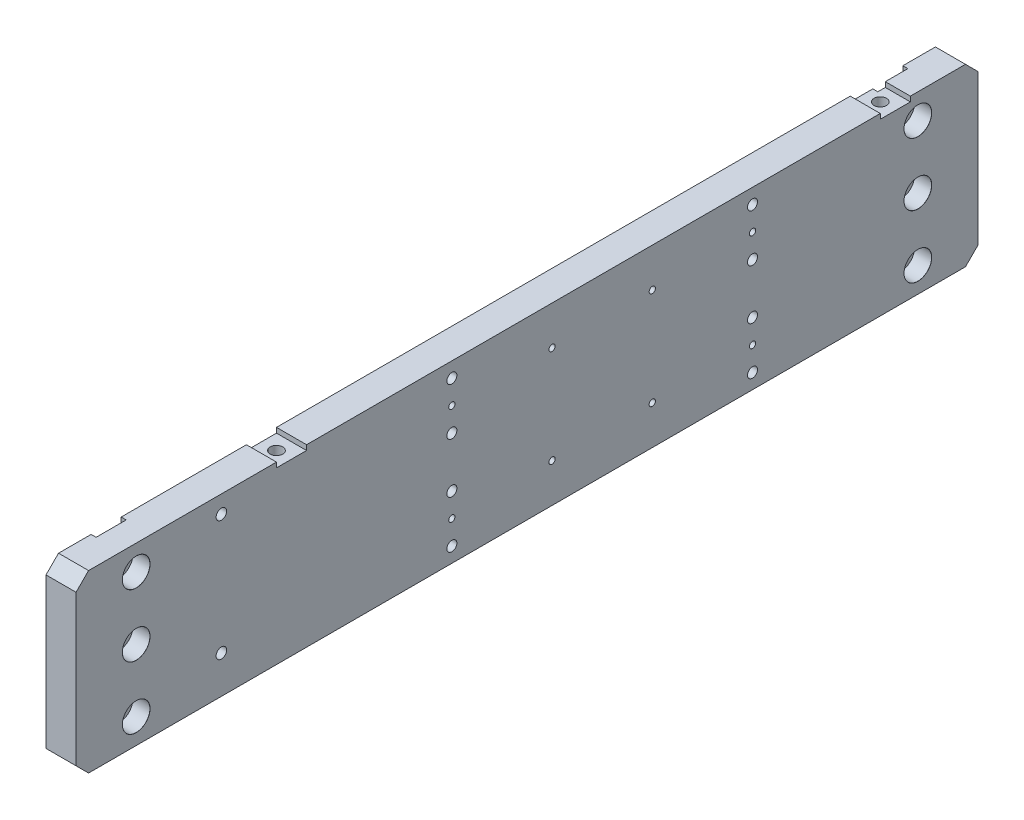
ISO-10303-21;
HEADER;
FILE_DESCRIPTION(('STEP AP214'),'2;1');
FILE_NAME('part.step','',(''),(''),'','','');
FILE_SCHEMA(('AUTOMOTIVE_DESIGN { 1 0 10303 214 1 1 1 1 }'));
ENDSEC;
DATA;
#1=APPLICATION_CONTEXT('core data for automotive mechanical design processes');
#2=APPLICATION_PROTOCOL_DEFINITION('international standard','automotive_design',2000,#1);
#3=PRODUCT_CONTEXT('',#1,'mechanical');
#4=PRODUCT('Part','Part','',(#3));
#5=PRODUCT_RELATED_PRODUCT_CATEGORY('part','',(#4));
#6=PRODUCT_DEFINITION_FORMATION('','',#4);
#7=PRODUCT_DEFINITION_CONTEXT('part definition',#1,'design');
#8=PRODUCT_DEFINITION('design','',#6,#7);
#9=PRODUCT_DEFINITION_SHAPE('','',#8);
#10=(LENGTH_UNIT() NAMED_UNIT(*) SI_UNIT(.MILLI.,.METRE.));
#11=(NAMED_UNIT(*) PLANE_ANGLE_UNIT() SI_UNIT($,.RADIAN.));
#12=(NAMED_UNIT(*) SI_UNIT($,.STERADIAN.) SOLID_ANGLE_UNIT());
#13=UNCERTAINTY_MEASURE_WITH_UNIT(LENGTH_MEASURE(1.E-05),#10,'distance_accuracy_value','');
#14=(GEOMETRIC_REPRESENTATION_CONTEXT(3) GLOBAL_UNCERTAINTY_ASSIGNED_CONTEXT((#13)) GLOBAL_UNIT_ASSIGNED_CONTEXT((#10,
#11,#12)) REPRESENTATION_CONTEXT('',''));
#15=CARTESIAN_POINT('',(0.,0.,0.));
#16=DIRECTION('',(0.,0.,1.));
#17=DIRECTION('',(1.,0.,0.));
#18=AXIS2_PLACEMENT_3D('',#15,#16,#17);
#19=CARTESIAN_POINT('',(159.801480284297,117.852870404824,-360.));
#20=DIRECTION('',(0.,1.,0.));
#21=DIRECTION('',(0.,0.,1.));
#22=AXIS2_PLACEMENT_3D('',#19,#20,#21);
#23=PLANE('',#22);
#24=DIRECTION('',(-1.,0.,0.));
#25=VECTOR('',#24,1.);
#26=CARTESIAN_POINT('',(171.801480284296,117.852870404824,-321.));
#27=LINE('',#26,#25);
#28=CARTESIAN_POINT('',(171.801480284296,117.852870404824,-321.));
#29=VERTEX_POINT('',#28);
#30=CARTESIAN_POINT('',(159.801480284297,117.852870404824,-321.));
#31=VERTEX_POINT('',#30);
#32=EDGE_CURVE('E217',#29,#31,#27,.T.);
#33=ORIENTED_EDGE('',*,*,#32,.T.);
#34=DIRECTION('',(0.,0.,1.));
#35=VECTOR('',#34,1.);
#36=CARTESIAN_POINT('',(159.801480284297,117.852870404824,-360.));
#37=LINE('',#36,#35);
#38=CARTESIAN_POINT('',(159.801480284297,117.852870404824,-92.));
#39=VERTEX_POINT('',#38);
#40=EDGE_CURVE('E466',#31,#39,#37,.T.);
#41=ORIENTED_EDGE('',*,*,#40,.T.);
#42=DIRECTION('',(-1.,0.,0.));
#43=VECTOR('',#42,1.);
#44=CARTESIAN_POINT('',(171.801480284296,117.852870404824,-92.));
#45=LINE('',#44,#43);
#46=CARTESIAN_POINT('',(171.801480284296,117.852870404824,-92.));
#47=VERTEX_POINT('',#46);
#48=EDGE_CURVE('E256',#47,#39,#45,.T.);
#49=ORIENTED_EDGE('',*,*,#48,.F.);
#50=DIRECTION('',(0.,0.,1.));
#51=VECTOR('',#50,1.);
#52=CARTESIAN_POINT('',(171.801480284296,117.852870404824,-360.));
#53=LINE('',#52,#51);
#54=EDGE_CURVE('E470',#29,#47,#53,.T.);
#55=ORIENTED_EDGE('',*,*,#54,.F.);
#56=EDGE_LOOP('',(#33,#41,#49,#55));
#57=FACE_BOUND('',#56,.T.);
#58=ADVANCED_FACE('F16',(#57),#23,.T.);
#59=CARTESIAN_POINT('',(159.801480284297,117.852870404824,-18.));
#60=VERTEX_POINT('',#59);
#61=CARTESIAN_POINT('',(159.801480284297,117.852870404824,-5.00000000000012));
#62=VERTEX_POINT('',#61);
#63=EDGE_CURVE('E467',#60,#62,#37,.T.);
#64=ORIENTED_EDGE('',*,*,#63,.T.);
#65=DIRECTION('',(1.,0.,0.));
#66=VECTOR('',#65,1.);
#67=CARTESIAN_POINT('',(171.801480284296,117.852870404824,-5.));
#68=LINE('',#67,#66);
#69=CARTESIAN_POINT('',(171.801480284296,117.852870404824,-5.));
#70=VERTEX_POINT('',#69);
#71=EDGE_CURVE('E506',#62,#70,#68,.T.);
#72=ORIENTED_EDGE('',*,*,#71,.T.);
#73=CARTESIAN_POINT('',(171.801480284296,117.852870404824,-80.));
#74=VERTEX_POINT('',#73);
#75=EDGE_CURVE('E471',#74,#70,#53,.T.);
#76=ORIENTED_EDGE('',*,*,#75,.F.);
#77=DIRECTION('',(-1.,0.,0.));
#78=VECTOR('',#77,1.);
#79=CARTESIAN_POINT('',(171.801480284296,117.852870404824,-80.));
#80=LINE('',#79,#78);
#81=CARTESIAN_POINT('',(159.801480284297,117.852870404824,-80.));
#82=VERTEX_POINT('',#81);
#83=EDGE_CURVE('E244',#74,#82,#80,.T.);
#84=ORIENTED_EDGE('',*,*,#83,.T.);
#85=CARTESIAN_POINT('',(159.801480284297,117.852870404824,-30.));
#86=VERTEX_POINT('',#85);
#87=EDGE_CURVE('E582',#82,#86,#37,.T.);
#88=ORIENTED_EDGE('',*,*,#87,.T.);
#89=DIRECTION('',(-1.,0.,0.));
#90=VECTOR('',#89,1.);
#91=CARTESIAN_POINT('',(159.801480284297,117.852870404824,-30.));
#92=LINE('',#91,#90);
#93=CARTESIAN_POINT('',(161.801480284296,117.852870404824,-30.));
#94=VERTEX_POINT('',#93);
#95=EDGE_CURVE('E429',#94,#86,#92,.T.);
#96=ORIENTED_EDGE('',*,*,#95,.F.);
#97=DIRECTION('',(0.,0.,-1.));
#98=VECTOR('',#97,1.);
#99=CARTESIAN_POINT('',(161.801480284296,117.852870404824,-18.));
#100=LINE('',#99,#98);
#101=CARTESIAN_POINT('',(161.801480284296,117.852870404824,-18.));
#102=VERTEX_POINT('',#101);
#103=EDGE_CURVE('E438',#102,#94,#100,.T.);
#104=ORIENTED_EDGE('',*,*,#103,.F.);
#105=DIRECTION('',(1.,0.,0.));
#106=VECTOR('',#105,1.);
#107=CARTESIAN_POINT('',(159.801480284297,117.852870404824,-18.));
#108=LINE('',#107,#106);
#109=EDGE_CURVE('E416',#60,#102,#108,.T.);
#110=ORIENTED_EDGE('',*,*,#109,.F.);
#111=EDGE_LOOP('',(#64,#72,#76,#84,#88,#96,#104,#110));
#112=FACE_BOUND('',#111,.T.);
#113=ADVANCED_FACE('F580',(#112),#23,.T.);
#114=CARTESIAN_POINT('',(159.801480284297,47.8528704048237,-360.));
#115=DIRECTION('',(-1.,0.,0.));
#116=DIRECTION('',(0.,0.,1.));
#117=AXIS2_PLACEMENT_3D('',#114,#115,#116);
#118=PLANE('',#117);
#119=DIRECTION('',(0.,-1.,0.));
#120=VECTOR('',#119,1.);
#121=CARTESIAN_POINT('',(159.801480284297,47.8528704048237,-360.));
#122=LINE('',#121,#120);
#123=CARTESIAN_POINT('',(159.801480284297,112.852870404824,-360.));
#124=VERTEX_POINT('',#123);
#125=CARTESIAN_POINT('',(159.801480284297,52.8528704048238,-360.));
#126=VERTEX_POINT('',#125);
#127=EDGE_CURVE('E452',#124,#126,#122,.T.);
#128=ORIENTED_EDGE('',*,*,#127,.T.);
#129=DIRECTION('',(0.,0.707106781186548,-0.707106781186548));
#130=VECTOR('',#129,1.);
#131=CARTESIAN_POINT('',(159.801480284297,50.3528704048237,-357.5));
#132=LINE('',#131,#130);
#133=CARTESIAN_POINT('',(159.801480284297,47.8528704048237,-355.));
#134=VERTEX_POINT('',#133);
#135=EDGE_CURVE('E24',#126,#134,#132,.F.);
#136=ORIENTED_EDGE('',*,*,#135,.T.);
#137=DIRECTION('',(0.,0.,1.));
#138=VECTOR('',#137,1.);
#139=CARTESIAN_POINT('',(159.801480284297,47.8528704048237,-360.));
#140=LINE('',#139,#138);
#141=CARTESIAN_POINT('',(159.801480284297,47.8528704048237,-342.));
#142=VERTEX_POINT('',#141);
#143=EDGE_CURVE('E475',#134,#142,#140,.T.);
#144=ORIENTED_EDGE('',*,*,#143,.T.);
#145=DIRECTION('',(0.,1.,0.));
#146=VECTOR('',#145,1.);
#147=CARTESIAN_POINT('',(159.801480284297,47.8528704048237,-342.));
#148=LINE('',#147,#146);
#149=CARTESIAN_POINT('',(159.801480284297,117.852870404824,-342.));
#150=VERTEX_POINT('',#149);
#151=EDGE_CURVE('E413',#142,#150,#148,.T.);
#152=ORIENTED_EDGE('',*,*,#151,.T.);
#153=CARTESIAN_POINT('',(159.801480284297,117.852870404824,-355.));
#154=VERTEX_POINT('',#153);
#155=EDGE_CURVE('E463',#154,#150,#37,.T.);
#156=ORIENTED_EDGE('',*,*,#155,.F.);
#157=DIRECTION('',(0.,0.707106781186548,0.707106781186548));
#158=VECTOR('',#157,1.);
#159=CARTESIAN_POINT('',(159.801480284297,80.3528704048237,-392.5));
#160=LINE('',#159,#158);
#161=EDGE_CURVE('E31',#154,#124,#160,.F.);
#162=ORIENTED_EDGE('',*,*,#161,.T.);
#163=EDGE_LOOP('',(#128,#136,#144,#152,#156,#162));
#164=FACE_BOUND('',#163,.T.);
#165=ADVANCED_FACE('F514',(#164),#118,.T.);
#166=CARTESIAN_POINT('',(159.801480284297,72.8528704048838,-150.));
#167=DIRECTION('',(1.,0.,0.));
#168=DIRECTION('',(0.,0.,-1.));
#169=AXIS2_PLACEMENT_3D('',#166,#167,#168);
#170=CIRCLE('',#169,2.);
#171=CARTESIAN_POINT('',(159.801480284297,72.8528704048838,-152.));
#172=VERTEX_POINT('',#171);
#173=EDGE_CURVE('E1402',#172,#172,#170,.T.);
#174=ORIENTED_EDGE('',*,*,#173,.T.);
#175=EDGE_LOOP('',(#174));
#176=FACE_BOUND('',#175,.T.);
#177=CARTESIAN_POINT('',(159.801480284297,53.8528704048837,-150.));
#178=DIRECTION('',(1.,0.,0.));
#179=DIRECTION('',(0.,0.,-1.));
#180=AXIS2_PLACEMENT_3D('',#177,#178,#179);
#181=CIRCLE('',#180,2.);
#182=CARTESIAN_POINT('',(159.801480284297,53.8528704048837,-152.));
#183=VERTEX_POINT('',#182);
#184=EDGE_CURVE('E1412',#183,#183,#181,.T.);
#185=ORIENTED_EDGE('',*,*,#184,.T.);
#186=EDGE_LOOP('',(#185));
#187=FACE_BOUND('',#186,.T.);
#188=CARTESIAN_POINT('',(159.801480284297,92.8528704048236,-150.));
#189=DIRECTION('',(1.,0.,0.));
#190=DIRECTION('',(0.,0.,-1.));
#191=AXIS2_PLACEMENT_3D('',#188,#189,#190);
#192=CIRCLE('',#191,2.);
#193=CARTESIAN_POINT('',(159.801480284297,92.8528704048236,-152.));
#194=VERTEX_POINT('',#193);
#195=EDGE_CURVE('E1418',#194,#194,#192,.T.);
#196=ORIENTED_EDGE('',*,*,#195,.T.);
#197=EDGE_LOOP('',(#196));
#198=FACE_BOUND('',#197,.T.);
#199=CARTESIAN_POINT('',(159.801480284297,111.852870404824,-150.));
#200=DIRECTION('',(1.,0.,0.));
#201=DIRECTION('',(0.,0.,-1.));
#202=AXIS2_PLACEMENT_3D('',#199,#200,#201);
#203=CIRCLE('',#202,2.);
#204=CARTESIAN_POINT('',(159.801480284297,111.852870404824,-152.));
#205=VERTEX_POINT('',#204);
#206=EDGE_CURVE('E1424',#205,#205,#203,.T.);
#207=ORIENTED_EDGE('',*,*,#206,.T.);
#208=EDGE_LOOP('',(#207));
#209=FACE_BOUND('',#208,.T.);
#210=CARTESIAN_POINT('',(159.801480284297,72.8528704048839,-270.));
#211=DIRECTION('',(1.,0.,0.));
#212=DIRECTION('',(0.,0.,-1.));
#213=AXIS2_PLACEMENT_3D('',#210,#211,#212);
#214=CIRCLE('',#213,2.);
#215=CARTESIAN_POINT('',(159.801480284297,72.8528704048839,-272.));
#216=VERTEX_POINT('',#215);
#217=EDGE_CURVE('E1430',#216,#216,#214,.T.);
#218=ORIENTED_EDGE('',*,*,#217,.T.);
#219=EDGE_LOOP('',(#218));
#220=FACE_BOUND('',#219,.T.);
#221=CARTESIAN_POINT('',(159.801480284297,92.8528704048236,-270.));
#222=DIRECTION('',(1.,0.,0.));
#223=DIRECTION('',(0.,0.,-1.));
#224=AXIS2_PLACEMENT_3D('',#221,#222,#223);
#225=CIRCLE('',#224,2.);
#226=CARTESIAN_POINT('',(159.801480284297,92.8528704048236,-272.));
#227=VERTEX_POINT('',#226);
#228=EDGE_CURVE('E1436',#227,#227,#225,.T.);
#229=ORIENTED_EDGE('',*,*,#228,.T.);
#230=EDGE_LOOP('',(#229));
#231=FACE_BOUND('',#230,.T.);
#232=CARTESIAN_POINT('',(159.801480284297,111.852870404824,-270.));
#233=DIRECTION('',(1.,0.,0.));
#234=DIRECTION('',(0.,0.,-1.));
#235=AXIS2_PLACEMENT_3D('',#232,#233,#234);
#236=CIRCLE('',#235,2.);
#237=CARTESIAN_POINT('',(159.801480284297,111.852870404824,-272.));
#238=VERTEX_POINT('',#237);
#239=EDGE_CURVE('E1442',#238,#238,#236,.T.);
#240=ORIENTED_EDGE('',*,*,#239,.T.);
#241=EDGE_LOOP('',(#240));
#242=FACE_BOUND('',#241,.T.);
#243=CARTESIAN_POINT('',(159.801480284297,53.8528704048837,-270.));
#244=DIRECTION('',(1.,0.,0.));
#245=DIRECTION('',(0.,0.,-1.));
#246=AXIS2_PLACEMENT_3D('',#243,#244,#245);
#247=CIRCLE('',#246,2.);
#248=CARTESIAN_POINT('',(159.801480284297,53.8528704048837,-272.));
#249=VERTEX_POINT('',#248);
#250=EDGE_CURVE('E1448',#249,#249,#247,.T.);
#251=ORIENTED_EDGE('',*,*,#250,.T.);
#252=EDGE_LOOP('',(#251));
#253=FACE_BOUND('',#252,.T.);
#254=CARTESIAN_POINT('',(159.801480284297,63.3528704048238,-150.));
#255=DIRECTION('',(1.,0.,0.));
#256=DIRECTION('',(0.,0.,-1.));
#257=AXIS2_PLACEMENT_3D('',#254,#255,#256);
#258=CIRCLE('',#257,1.25);
#259=CARTESIAN_POINT('',(159.801480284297,63.3528704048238,-151.25));
#260=VERTEX_POINT('',#259);
#261=EDGE_CURVE('E1454',#260,#260,#258,.T.);
#262=ORIENTED_EDGE('',*,*,#261,.T.);
#263=EDGE_LOOP('',(#262));
#264=FACE_BOUND('',#263,.T.);
#265=CARTESIAN_POINT('',(159.801480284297,63.3528704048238,-190.));
#266=DIRECTION('',(1.,0.,0.));
#267=DIRECTION('',(0.,0.,-1.));
#268=AXIS2_PLACEMENT_3D('',#265,#266,#267);
#269=CIRCLE('',#268,1.25);
#270=CARTESIAN_POINT('',(159.801480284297,63.3528704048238,-191.25));
#271=VERTEX_POINT('',#270);
#272=EDGE_CURVE('E1460',#271,#271,#269,.T.);
#273=ORIENTED_EDGE('',*,*,#272,.T.);
#274=EDGE_LOOP('',(#273));
#275=FACE_BOUND('',#274,.T.);
#276=CARTESIAN_POINT('',(159.801480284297,63.3528704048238,-230.));
#277=DIRECTION('',(1.,0.,0.));
#278=DIRECTION('',(0.,0.,-1.));
#279=AXIS2_PLACEMENT_3D('',#276,#277,#278);
#280=CIRCLE('',#279,1.25);
#281=CARTESIAN_POINT('',(159.801480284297,63.3528704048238,-231.25));
#282=VERTEX_POINT('',#281);
#283=EDGE_CURVE('E1466',#282,#282,#280,.T.);
#284=ORIENTED_EDGE('',*,*,#283,.T.);
#285=EDGE_LOOP('',(#284));
#286=FACE_BOUND('',#285,.T.);
#287=CARTESIAN_POINT('',(159.801480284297,63.3528704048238,-270.));
#288=DIRECTION('',(1.,0.,0.));
#289=DIRECTION('',(0.,0.,-1.));
#290=AXIS2_PLACEMENT_3D('',#287,#288,#289);
#291=CIRCLE('',#290,1.25);
#292=CARTESIAN_POINT('',(159.801480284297,63.3528704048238,-271.25));
#293=VERTEX_POINT('',#292);
#294=EDGE_CURVE('E1472',#293,#293,#291,.T.);
#295=ORIENTED_EDGE('',*,*,#294,.T.);
#296=EDGE_LOOP('',(#295));
#297=FACE_BOUND('',#296,.T.);
#298=CARTESIAN_POINT('',(159.801480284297,102.352870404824,-270.));
#299=DIRECTION('',(1.,0.,0.));
#300=DIRECTION('',(0.,0.,-1.));
#301=AXIS2_PLACEMENT_3D('',#298,#299,#300);
#302=CIRCLE('',#301,1.25);
#303=CARTESIAN_POINT('',(159.801480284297,102.352870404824,-271.25));
#304=VERTEX_POINT('',#303);
#305=EDGE_CURVE('E1478',#304,#304,#302,.T.);
#306=ORIENTED_EDGE('',*,*,#305,.T.);
#307=EDGE_LOOP('',(#306));
#308=FACE_BOUND('',#307,.T.);
#309=CARTESIAN_POINT('',(159.801480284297,102.352870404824,-230.));
#310=DIRECTION('',(1.,0.,0.));
#311=DIRECTION('',(0.,0.,-1.));
#312=AXIS2_PLACEMENT_3D('',#309,#310,#311);
#313=CIRCLE('',#312,1.25);
#314=CARTESIAN_POINT('',(159.801480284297,102.352870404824,-231.25));
#315=VERTEX_POINT('',#314);
#316=EDGE_CURVE('E1484',#315,#315,#313,.T.);
#317=ORIENTED_EDGE('',*,*,#316,.T.);
#318=EDGE_LOOP('',(#317));
#319=FACE_BOUND('',#318,.T.);
#320=CARTESIAN_POINT('',(159.801480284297,102.352870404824,-190.));
#321=DIRECTION('',(1.,0.,0.));
#322=DIRECTION('',(0.,0.,-1.));
#323=AXIS2_PLACEMENT_3D('',#320,#321,#322);
#324=CIRCLE('',#323,1.25);
#325=CARTESIAN_POINT('',(159.801480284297,102.352870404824,-191.25));
#326=VERTEX_POINT('',#325);
#327=EDGE_CURVE('E1490',#326,#326,#324,.T.);
#328=ORIENTED_EDGE('',*,*,#327,.T.);
#329=EDGE_LOOP('',(#328));
#330=FACE_BOUND('',#329,.T.);
#331=CARTESIAN_POINT('',(159.801480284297,102.352870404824,-150.));
#332=DIRECTION('',(1.,0.,0.));
#333=DIRECTION('',(0.,0.,-1.));
#334=AXIS2_PLACEMENT_3D('',#331,#332,#333);
#335=CIRCLE('',#334,1.25);
#336=CARTESIAN_POINT('',(159.801480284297,102.352870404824,-151.25));
#337=VERTEX_POINT('',#336);
#338=EDGE_CURVE('E200',#337,#337,#335,.T.);
#339=ORIENTED_EDGE('',*,*,#338,.T.);
#340=EDGE_LOOP('',(#339));
#341=FACE_BOUND('',#340,.T.);
#342=DIRECTION('',(0.,1.,0.));
#343=VECTOR('',#342,1.);
#344=CARTESIAN_POINT('',(159.801480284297,117.852870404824,-321.));
#345=LINE('',#344,#343);
#346=CARTESIAN_POINT('',(159.801480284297,115.852870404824,-321.));
#347=VERTEX_POINT('',#346);
#348=EDGE_CURVE('E206',#347,#31,#345,.T.);
#349=ORIENTED_EDGE('',*,*,#348,.F.);
#350=DIRECTION('',(0.,0.,1.));
#351=VECTOR('',#350,1.);
#352=CARTESIAN_POINT('',(159.801480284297,115.852870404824,-321.));
#353=LINE('',#352,#351);
#354=CARTESIAN_POINT('',(159.801480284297,115.852870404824,-330.));
#355=VERTEX_POINT('',#354);
#356=EDGE_CURVE('E211',#355,#347,#353,.T.);
#357=ORIENTED_EDGE('',*,*,#356,.F.);
#358=DIRECTION('',(0.,1.,0.));
#359=VECTOR('',#358,1.);
#360=CARTESIAN_POINT('',(159.801480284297,47.8528704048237,-330.));
#361=LINE('',#360,#359);
#362=CARTESIAN_POINT('',(159.801480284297,47.8528704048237,-330.));
#363=VERTEX_POINT('',#362);
#364=EDGE_CURVE('E409',#363,#355,#361,.T.);
#365=ORIENTED_EDGE('',*,*,#364,.F.);
#366=CARTESIAN_POINT('',(159.801480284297,47.8528704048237,-30.));
#367=VERTEX_POINT('',#366);
#368=EDGE_CURVE('E477',#363,#367,#140,.T.);
#369=ORIENTED_EDGE('',*,*,#368,.T.);
#370=DIRECTION('',(0.,1.,0.));
#371=VECTOR('',#370,1.);
#372=CARTESIAN_POINT('',(159.801480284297,47.8528704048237,-30.));
#373=LINE('',#372,#371);
#374=EDGE_CURVE('E443',#367,#86,#373,.T.);
#375=ORIENTED_EDGE('',*,*,#374,.T.);
#376=ORIENTED_EDGE('',*,*,#87,.F.);
#377=DIRECTION('',(0.,1.,0.));
#378=VECTOR('',#377,1.);
#379=CARTESIAN_POINT('',(159.801480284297,117.852870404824,-80.));
#380=LINE('',#379,#378);
#381=CARTESIAN_POINT('',(159.801480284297,115.852870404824,-80.));
#382=VERTEX_POINT('',#381);
#383=EDGE_CURVE('E233',#382,#82,#380,.T.);
#384=ORIENTED_EDGE('',*,*,#383,.F.);
#385=DIRECTION('',(0.,0.,1.));
#386=VECTOR('',#385,1.);
#387=CARTESIAN_POINT('',(159.801480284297,115.852870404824,-80.));
#388=LINE('',#387,#386);
#389=CARTESIAN_POINT('',(159.801480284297,115.852870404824,-92.));
#390=VERTEX_POINT('',#389);
#391=EDGE_CURVE('E238',#390,#382,#388,.T.);
#392=ORIENTED_EDGE('',*,*,#391,.F.);
#393=DIRECTION('',(0.,-1.,0.));
#394=VECTOR('',#393,1.);
#395=CARTESIAN_POINT('',(159.801480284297,117.852870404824,-92.));
#396=LINE('',#395,#394);
#397=EDGE_CURVE('E246',#39,#390,#396,.T.);
#398=ORIENTED_EDGE('',*,*,#397,.F.);
#399=ORIENTED_EDGE('',*,*,#40,.F.);
#400=EDGE_LOOP('',(#349,#357,#365,#369,#375,#376,#384,#392,#398,#399));
#401=FACE_BOUND('',#400,.T.);
#402=CARTESIAN_POINT('',(159.801480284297,62.8518695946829,-58.));
#403=DIRECTION('',(1.,0.,0.));
#404=DIRECTION('',(0.,0.,-1.));
#405=AXIS2_PLACEMENT_3D('',#402,#403,#404);
#406=CIRCLE('',#405,2.1);
#407=CARTESIAN_POINT('',(159.801480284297,62.8518695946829,-60.1));
#408=VERTEX_POINT('',#407);
#409=EDGE_CURVE('E263',#408,#408,#406,.T.);
#410=ORIENTED_EDGE('',*,*,#409,.T.);
#411=EDGE_LOOP('',(#410));
#412=FACE_BOUND('',#411,.T.);
#413=CARTESIAN_POINT('',(159.801480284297,110.851869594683,-58.));
#414=DIRECTION('',(1.,0.,0.));
#415=DIRECTION('',(0.,0.,-1.));
#416=AXIS2_PLACEMENT_3D('',#413,#414,#415);
#417=CIRCLE('',#416,2.1);
#418=CARTESIAN_POINT('',(159.801480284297,110.851869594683,-60.1));
#419=VERTEX_POINT('',#418);
#420=EDGE_CURVE('E269',#419,#419,#417,.T.);
#421=ORIENTED_EDGE('',*,*,#420,.T.);
#422=EDGE_LOOP('',(#421));
#423=FACE_BOUND('',#422,.T.);
#424=ADVANCED_FACE('F552',(#176,#187,#198,#209,#220,#231,#242,#253,#264,#275,#286,#297,#308,
#319,#330,#341,#401,#412,#423),#118,.T.);
#425=CARTESIAN_POINT('',(159.801480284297,47.8528704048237,-18.));
#426=VERTEX_POINT('',#425);
#427=CARTESIAN_POINT('',(159.801480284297,47.8528704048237,-5.));
#428=VERTEX_POINT('',#427);
#429=EDGE_CURVE('E458',#426,#428,#140,.T.);
#430=ORIENTED_EDGE('',*,*,#429,.T.);
#431=DIRECTION('',(0.,0.707106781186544,0.707106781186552));
#432=VECTOR('',#431,1.);
#433=CARTESIAN_POINT('',(159.801480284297,-129.647129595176,-182.5));
#434=LINE('',#433,#432);
#435=CARTESIAN_POINT('',(159.801480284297,52.8528704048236,0.));
#436=VERTEX_POINT('',#435);
#437=EDGE_CURVE('E504',#428,#436,#434,.T.);
#438=ORIENTED_EDGE('',*,*,#437,.T.);
#439=DIRECTION('',(0.,-1.,0.));
#440=VECTOR('',#439,1.);
#441=CARTESIAN_POINT('',(159.801480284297,47.8528704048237,0.));
#442=LINE('',#441,#440);
#443=CARTESIAN_POINT('',(159.801480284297,112.852870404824,0.));
#444=VERTEX_POINT('',#443);
#445=EDGE_CURVE('E446',#444,#436,#442,.T.);
#446=ORIENTED_EDGE('',*,*,#445,.F.);
#447=DIRECTION('',(0.,0.707106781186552,-0.707106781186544));
#448=VECTOR('',#447,1.);
#449=CARTESIAN_POINT('',(159.801480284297,260.352870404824,-147.499999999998));
#450=LINE('',#449,#448);
#451=EDGE_CURVE('E502',#444,#62,#450,.T.);
#452=ORIENTED_EDGE('',*,*,#451,.T.);
#453=ORIENTED_EDGE('',*,*,#63,.F.);
#454=DIRECTION('',(0.,1.,0.));
#455=VECTOR('',#454,1.);
#456=CARTESIAN_POINT('',(159.801480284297,47.8528704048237,-18.));
#457=LINE('',#456,#455);
#458=EDGE_CURVE('E435',#426,#60,#457,.T.);
#459=ORIENTED_EDGE('',*,*,#458,.F.);
#460=EDGE_LOOP('',(#430,#438,#446,#452,#453,#459));
#461=FACE_BOUND('',#460,.T.);
#462=ADVANCED_FACE('F561',(#461),#118,.T.);
#463=CARTESIAN_POINT('',(171.801480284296,117.852870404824,-355.));
#464=VERTEX_POINT('',#463);
#465=CARTESIAN_POINT('',(171.801480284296,117.852870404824,-333.));
#466=VERTEX_POINT('',#465);
#467=EDGE_CURVE('E468',#464,#466,#53,.T.);
#468=ORIENTED_EDGE('',*,*,#467,.F.);
#469=DIRECTION('',(-1.,0.,0.));
#470=VECTOR('',#469,1.);
#471=CARTESIAN_POINT('',(159.801480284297,117.852870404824,-355.));
#472=LINE('',#471,#470);
#473=EDGE_CURVE('E11',#464,#154,#472,.T.);
#474=ORIENTED_EDGE('',*,*,#473,.T.);
#475=ORIENTED_EDGE('',*,*,#155,.T.);
#476=DIRECTION('',(-1.,0.,0.));
#477=VECTOR('',#476,1.);
#478=CARTESIAN_POINT('',(159.801480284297,117.852870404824,-342.));
#479=LINE('',#478,#477);
#480=CARTESIAN_POINT('',(161.801480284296,117.852870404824,-342.));
#481=VERTEX_POINT('',#480);
#482=EDGE_CURVE('E403',#481,#150,#479,.T.);
#483=ORIENTED_EDGE('',*,*,#482,.F.);
#484=DIRECTION('',(0.,0.,-1.));
#485=VECTOR('',#484,1.);
#486=CARTESIAN_POINT('',(161.801480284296,117.852870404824,-330.));
#487=LINE('',#486,#485);
#488=CARTESIAN_POINT('',(161.801480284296,117.852870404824,-333.));
#489=VERTEX_POINT('',#488);
#490=EDGE_CURVE('E398',#489,#481,#487,.T.);
#491=ORIENTED_EDGE('',*,*,#490,.F.);
#492=DIRECTION('',(-1.,0.,0.));
#493=VECTOR('',#492,1.);
#494=CARTESIAN_POINT('',(171.801480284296,117.852870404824,-333.));
#495=LINE('',#494,#493);
#496=EDGE_CURVE('E227',#466,#489,#495,.T.);
#497=ORIENTED_EDGE('',*,*,#496,.F.);
#498=EDGE_LOOP('',(#468,#474,#475,#483,#491,#497));
#499=FACE_BOUND('',#498,.T.);
#500=ADVANCED_FACE('F533',(#499),#23,.T.);
#501=CARTESIAN_POINT('',(171.801480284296,47.8528704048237,-360.));
#502=DIRECTION('',(1.,0.,0.));
#503=DIRECTION('',(0.,0.,-1.));
#504=AXIS2_PLACEMENT_3D('',#501,#502,#503);
#505=PLANE('',#504);
#506=CARTESIAN_POINT('',(171.801480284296,72.8528704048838,-150.));
#507=DIRECTION('',(1.,0.,0.));
#508=DIRECTION('',(0.,0.,-1.));
#509=AXIS2_PLACEMENT_3D('',#506,#507,#508);
#510=CIRCLE('',#509,2.);
#511=CARTESIAN_POINT('',(171.801480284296,72.8528704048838,-152.));
#512=VERTEX_POINT('',#511);
#513=EDGE_CURVE('E1405',#512,#512,#510,.T.);
#514=ORIENTED_EDGE('',*,*,#513,.F.);
#515=EDGE_LOOP('',(#514));
#516=FACE_BOUND('',#515,.T.);
#517=CARTESIAN_POINT('',(171.801480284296,53.8528704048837,-150.));
#518=DIRECTION('',(1.,0.,0.));
#519=DIRECTION('',(0.,0.,-1.));
#520=AXIS2_PLACEMENT_3D('',#517,#518,#519);
#521=CIRCLE('',#520,2.);
#522=CARTESIAN_POINT('',(171.801480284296,53.8528704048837,-152.));
#523=VERTEX_POINT('',#522);
#524=EDGE_CURVE('E1407',#523,#523,#521,.T.);
#525=ORIENTED_EDGE('',*,*,#524,.F.);
#526=EDGE_LOOP('',(#525));
#527=FACE_BOUND('',#526,.T.);
#528=CARTESIAN_POINT('',(171.801480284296,92.8528704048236,-150.));
#529=DIRECTION('',(1.,0.,0.));
#530=DIRECTION('',(0.,0.,-1.));
#531=AXIS2_PLACEMENT_3D('',#528,#529,#530);
#532=CIRCLE('',#531,2.);
#533=CARTESIAN_POINT('',(171.801480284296,92.8528704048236,-152.));
#534=VERTEX_POINT('',#533);
#535=EDGE_CURVE('E1415',#534,#534,#532,.T.);
#536=ORIENTED_EDGE('',*,*,#535,.F.);
#537=EDGE_LOOP('',(#536));
#538=FACE_BOUND('',#537,.T.);
#539=CARTESIAN_POINT('',(171.801480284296,111.852870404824,-150.));
#540=DIRECTION('',(1.,0.,0.));
#541=DIRECTION('',(0.,0.,-1.));
#542=AXIS2_PLACEMENT_3D('',#539,#540,#541);
#543=CIRCLE('',#542,2.);
#544=CARTESIAN_POINT('',(171.801480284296,111.852870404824,-152.));
#545=VERTEX_POINT('',#544);
#546=EDGE_CURVE('E1421',#545,#545,#543,.T.);
#547=ORIENTED_EDGE('',*,*,#546,.F.);
#548=EDGE_LOOP('',(#547));
#549=FACE_BOUND('',#548,.T.);
#550=CARTESIAN_POINT('',(171.801480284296,72.8528704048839,-270.));
#551=DIRECTION('',(1.,0.,0.));
#552=DIRECTION('',(0.,0.,-1.));
#553=AXIS2_PLACEMENT_3D('',#550,#551,#552);
#554=CIRCLE('',#553,2.);
#555=CARTESIAN_POINT('',(171.801480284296,72.8528704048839,-272.));
#556=VERTEX_POINT('',#555);
#557=EDGE_CURVE('E1427',#556,#556,#554,.T.);
#558=ORIENTED_EDGE('',*,*,#557,.F.);
#559=EDGE_LOOP('',(#558));
#560=FACE_BOUND('',#559,.T.);
#561=CARTESIAN_POINT('',(171.801480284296,92.8528704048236,-270.));
#562=DIRECTION('',(1.,0.,0.));
#563=DIRECTION('',(0.,0.,-1.));
#564=AXIS2_PLACEMENT_3D('',#561,#562,#563);
#565=CIRCLE('',#564,2.);
#566=CARTESIAN_POINT('',(171.801480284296,92.8528704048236,-272.));
#567=VERTEX_POINT('',#566);
#568=EDGE_CURVE('E1433',#567,#567,#565,.T.);
#569=ORIENTED_EDGE('',*,*,#568,.F.);
#570=EDGE_LOOP('',(#569));
#571=FACE_BOUND('',#570,.T.);
#572=CARTESIAN_POINT('',(171.801480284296,111.852870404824,-270.));
#573=DIRECTION('',(1.,0.,0.));
#574=DIRECTION('',(0.,0.,-1.));
#575=AXIS2_PLACEMENT_3D('',#572,#573,#574);
#576=CIRCLE('',#575,2.);
#577=CARTESIAN_POINT('',(171.801480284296,111.852870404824,-272.));
#578=VERTEX_POINT('',#577);
#579=EDGE_CURVE('E1439',#578,#578,#576,.T.);
#580=ORIENTED_EDGE('',*,*,#579,.F.);
#581=EDGE_LOOP('',(#580));
#582=FACE_BOUND('',#581,.T.);
#583=CARTESIAN_POINT('',(171.801480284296,53.8528704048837,-270.));
#584=DIRECTION('',(1.,0.,0.));
#585=DIRECTION('',(0.,0.,-1.));
#586=AXIS2_PLACEMENT_3D('',#583,#584,#585);
#587=CIRCLE('',#586,2.);
#588=CARTESIAN_POINT('',(171.801480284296,53.8528704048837,-272.));
#589=VERTEX_POINT('',#588);
#590=EDGE_CURVE('E1445',#589,#589,#587,.T.);
#591=ORIENTED_EDGE('',*,*,#590,.F.);
#592=EDGE_LOOP('',(#591));
#593=FACE_BOUND('',#592,.T.);
#594=CARTESIAN_POINT('',(171.801480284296,63.3528704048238,-150.));
#595=DIRECTION('',(1.,0.,0.));
#596=DIRECTION('',(0.,0.,-1.));
#597=AXIS2_PLACEMENT_3D('',#594,#595,#596);
#598=CIRCLE('',#597,1.25);
#599=CARTESIAN_POINT('',(171.801480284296,63.3528704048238,-151.25));
#600=VERTEX_POINT('',#599);
#601=EDGE_CURVE('E1451',#600,#600,#598,.T.);
#602=ORIENTED_EDGE('',*,*,#601,.F.);
#603=EDGE_LOOP('',(#602));
#604=FACE_BOUND('',#603,.T.);
#605=CARTESIAN_POINT('',(171.801480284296,63.3528704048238,-190.));
#606=DIRECTION('',(1.,0.,0.));
#607=DIRECTION('',(0.,0.,-1.));
#608=AXIS2_PLACEMENT_3D('',#605,#606,#607);
#609=CIRCLE('',#608,1.25);
#610=CARTESIAN_POINT('',(171.801480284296,63.3528704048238,-191.25));
#611=VERTEX_POINT('',#610);
#612=EDGE_CURVE('E1457',#611,#611,#609,.T.);
#613=ORIENTED_EDGE('',*,*,#612,.F.);
#614=EDGE_LOOP('',(#613));
#615=FACE_BOUND('',#614,.T.);
#616=CARTESIAN_POINT('',(171.801480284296,63.3528704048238,-230.));
#617=DIRECTION('',(1.,0.,0.));
#618=DIRECTION('',(0.,0.,-1.));
#619=AXIS2_PLACEMENT_3D('',#616,#617,#618);
#620=CIRCLE('',#619,1.25);
#621=CARTESIAN_POINT('',(171.801480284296,63.3528704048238,-231.25));
#622=VERTEX_POINT('',#621);
#623=EDGE_CURVE('E1463',#622,#622,#620,.T.);
#624=ORIENTED_EDGE('',*,*,#623,.F.);
#625=EDGE_LOOP('',(#624));
#626=FACE_BOUND('',#625,.T.);
#627=CARTESIAN_POINT('',(171.801480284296,63.3528704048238,-270.));
#628=DIRECTION('',(1.,0.,0.));
#629=DIRECTION('',(0.,0.,-1.));
#630=AXIS2_PLACEMENT_3D('',#627,#628,#629);
#631=CIRCLE('',#630,1.25);
#632=CARTESIAN_POINT('',(171.801480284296,63.3528704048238,-271.25));
#633=VERTEX_POINT('',#632);
#634=EDGE_CURVE('E1469',#633,#633,#631,.T.);
#635=ORIENTED_EDGE('',*,*,#634,.F.);
#636=EDGE_LOOP('',(#635));
#637=FACE_BOUND('',#636,.T.);
#638=CARTESIAN_POINT('',(171.801480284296,102.352870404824,-270.));
#639=DIRECTION('',(1.,0.,0.));
#640=DIRECTION('',(0.,0.,-1.));
#641=AXIS2_PLACEMENT_3D('',#638,#639,#640);
#642=CIRCLE('',#641,1.25);
#643=CARTESIAN_POINT('',(171.801480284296,102.352870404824,-271.25));
#644=VERTEX_POINT('',#643);
#645=EDGE_CURVE('E1475',#644,#644,#642,.T.);
#646=ORIENTED_EDGE('',*,*,#645,.F.);
#647=EDGE_LOOP('',(#646));
#648=FACE_BOUND('',#647,.T.);
#649=CARTESIAN_POINT('',(171.801480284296,102.352870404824,-230.));
#650=DIRECTION('',(1.,0.,0.));
#651=DIRECTION('',(0.,0.,-1.));
#652=AXIS2_PLACEMENT_3D('',#649,#650,#651);
#653=CIRCLE('',#652,1.25);
#654=CARTESIAN_POINT('',(171.801480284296,102.352870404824,-231.25));
#655=VERTEX_POINT('',#654);
#656=EDGE_CURVE('E1481',#655,#655,#653,.T.);
#657=ORIENTED_EDGE('',*,*,#656,.F.);
#658=EDGE_LOOP('',(#657));
#659=FACE_BOUND('',#658,.T.);
#660=CARTESIAN_POINT('',(171.801480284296,102.352870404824,-190.));
#661=DIRECTION('',(1.,0.,0.));
#662=DIRECTION('',(0.,0.,-1.));
#663=AXIS2_PLACEMENT_3D('',#660,#661,#662);
#664=CIRCLE('',#663,1.25);
#665=CARTESIAN_POINT('',(171.801480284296,102.352870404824,-191.25));
#666=VERTEX_POINT('',#665);
#667=EDGE_CURVE('E1487',#666,#666,#664,.T.);
#668=ORIENTED_EDGE('',*,*,#667,.F.);
#669=EDGE_LOOP('',(#668));
#670=FACE_BOUND('',#669,.T.);
#671=CARTESIAN_POINT('',(171.801480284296,102.352870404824,-150.));
#672=DIRECTION('',(1.,0.,0.));
#673=DIRECTION('',(0.,0.,-1.));
#674=AXIS2_PLACEMENT_3D('',#671,#672,#673);
#675=CIRCLE('',#674,1.25);
#676=CARTESIAN_POINT('',(171.801480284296,102.352870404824,-151.25));
#677=VERTEX_POINT('',#676);
#678=EDGE_CURVE('E1493',#677,#677,#675,.T.);
#679=ORIENTED_EDGE('',*,*,#678,.F.);
#680=EDGE_LOOP('',(#679));
#681=FACE_BOUND('',#680,.T.);
#682=DIRECTION('',(0.,1.,0.));
#683=VECTOR('',#682,1.);
#684=CARTESIAN_POINT('',(171.801480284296,47.8528704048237,0.));
#685=LINE('',#684,#683);
#686=CARTESIAN_POINT('',(171.801480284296,52.8528704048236,0.));
#687=VERTEX_POINT('',#686);
#688=CARTESIAN_POINT('',(171.801480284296,112.852870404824,0.));
#689=VERTEX_POINT('',#688);
#690=EDGE_CURVE('E455',#687,#689,#685,.T.);
#691=ORIENTED_EDGE('',*,*,#690,.F.);
#692=DIRECTION('',(0.,-0.707106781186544,-0.707106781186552));
#693=VECTOR('',#692,1.);
#694=CARTESIAN_POINT('',(171.801480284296,-129.647129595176,-182.5));
#695=LINE('',#694,#693);
#696=CARTESIAN_POINT('',(171.801480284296,47.8528704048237,-5.00000000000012));
#697=VERTEX_POINT('',#696);
#698=EDGE_CURVE('E495',#687,#697,#695,.T.);
#699=ORIENTED_EDGE('',*,*,#698,.T.);
#700=DIRECTION('',(0.,0.,1.));
#701=VECTOR('',#700,1.);
#702=CARTESIAN_POINT('',(171.801480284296,47.8528704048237,-360.));
#703=LINE('',#702,#701);
#704=CARTESIAN_POINT('',(171.801480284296,47.8528704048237,-355.));
#705=VERTEX_POINT('',#704);
#706=EDGE_CURVE('E472',#705,#697,#703,.T.);
#707=ORIENTED_EDGE('',*,*,#706,.F.);
#708=DIRECTION('',(0.,-0.707106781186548,0.707106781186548));
#709=VECTOR('',#708,1.);
#710=CARTESIAN_POINT('',(171.801480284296,50.3528704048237,-357.5));
#711=LINE('',#710,#709);
#712=CARTESIAN_POINT('',(171.801480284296,52.8528704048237,-360.));
#713=VERTEX_POINT('',#712);
#714=EDGE_CURVE('E491',#705,#713,#711,.F.);
#715=ORIENTED_EDGE('',*,*,#714,.T.);
#716=DIRECTION('',(0.,1.,0.));
#717=VECTOR('',#716,1.);
#718=CARTESIAN_POINT('',(171.801480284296,47.8528704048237,-360.));
#719=LINE('',#718,#717);
#720=CARTESIAN_POINT('',(171.801480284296,112.852870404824,-360.));
#721=VERTEX_POINT('',#720);
#722=EDGE_CURVE('E454',#713,#721,#719,.T.);
#723=ORIENTED_EDGE('',*,*,#722,.T.);
#724=DIRECTION('',(0.,-0.707106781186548,-0.707106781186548));
#725=VECTOR('',#724,1.);
#726=CARTESIAN_POINT('',(171.801480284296,80.3528704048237,-392.5));
#727=LINE('',#726,#725);
#728=EDGE_CURVE('E489',#721,#464,#727,.F.);
#729=ORIENTED_EDGE('',*,*,#728,.T.);
#730=ORIENTED_EDGE('',*,*,#467,.T.);
#731=DIRECTION('',(0.,-1.,0.));
#732=VECTOR('',#731,1.);
#733=CARTESIAN_POINT('',(171.801480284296,117.852870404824,-333.));
#734=LINE('',#733,#732);
#735=CARTESIAN_POINT('',(171.801480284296,115.852870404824,-333.));
#736=VERTEX_POINT('',#735);
#737=EDGE_CURVE('E210',#466,#736,#734,.T.);
#738=ORIENTED_EDGE('',*,*,#737,.T.);
#739=DIRECTION('',(0.,0.,1.));
#740=VECTOR('',#739,1.);
#741=CARTESIAN_POINT('',(171.801480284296,115.852870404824,-321.));
#742=LINE('',#741,#740);
#743=CARTESIAN_POINT('',(171.801480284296,115.852870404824,-321.));
#744=VERTEX_POINT('',#743);
#745=EDGE_CURVE('E214',#736,#744,#742,.T.);
#746=ORIENTED_EDGE('',*,*,#745,.T.);
#747=DIRECTION('',(0.,1.,0.));
#748=VECTOR('',#747,1.);
#749=CARTESIAN_POINT('',(171.801480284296,117.852870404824,-321.));
#750=LINE('',#749,#748);
#751=EDGE_CURVE('E207',#744,#29,#750,.T.);
#752=ORIENTED_EDGE('',*,*,#751,.T.);
#753=ORIENTED_EDGE('',*,*,#54,.T.);
#754=DIRECTION('',(0.,-1.,0.));
#755=VECTOR('',#754,1.);
#756=CARTESIAN_POINT('',(171.801480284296,117.852870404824,-92.));
#757=LINE('',#756,#755);
#758=CARTESIAN_POINT('',(171.801480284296,115.852870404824,-92.));
#759=VERTEX_POINT('',#758);
#760=EDGE_CURVE('E237',#47,#759,#757,.T.);
#761=ORIENTED_EDGE('',*,*,#760,.T.);
#762=DIRECTION('',(0.,0.,1.));
#763=VECTOR('',#762,1.);
#764=CARTESIAN_POINT('',(171.801480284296,115.852870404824,-80.));
#765=LINE('',#764,#763);
#766=CARTESIAN_POINT('',(171.801480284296,115.852870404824,-80.));
#767=VERTEX_POINT('',#766);
#768=EDGE_CURVE('E241',#759,#767,#765,.T.);
#769=ORIENTED_EDGE('',*,*,#768,.T.);
#770=DIRECTION('',(0.,1.,0.));
#771=VECTOR('',#770,1.);
#772=CARTESIAN_POINT('',(171.801480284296,117.852870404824,-80.));
#773=LINE('',#772,#771);
#774=EDGE_CURVE('E234',#767,#74,#773,.T.);
#775=ORIENTED_EDGE('',*,*,#774,.T.);
#776=ORIENTED_EDGE('',*,*,#75,.T.);
#777=DIRECTION('',(0.,-0.707106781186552,0.707106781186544));
#778=VECTOR('',#777,1.);
#779=CARTESIAN_POINT('',(171.801480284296,260.352870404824,-147.499999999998));
#780=LINE('',#779,#778);
#781=EDGE_CURVE('E493',#70,#689,#780,.T.);
#782=ORIENTED_EDGE('',*,*,#781,.T.);
#783=EDGE_LOOP('',(#691,#699,#707,#715,#723,#729,#730,#738,#746,#752,#753,#761,#769,#775,#776,#782));
#784=FACE_BOUND('',#783,.T.);
#785=CARTESIAN_POINT('',(171.801480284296,62.8518695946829,-58.));
#786=DIRECTION('',(1.,0.,0.));
#787=DIRECTION('',(0.,0.,-1.));
#788=AXIS2_PLACEMENT_3D('',#785,#786,#787);
#789=CIRCLE('',#788,2.1);
#790=CARTESIAN_POINT('',(171.801480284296,62.8518695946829,-60.1));
#791=VERTEX_POINT('',#790);
#792=EDGE_CURVE('E253',#791,#791,#789,.T.);
#793=ORIENTED_EDGE('',*,*,#792,.F.);
#794=EDGE_LOOP('',(#793));
#795=FACE_BOUND('',#794,.T.);
#796=CARTESIAN_POINT('',(171.801480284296,110.851869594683,-58.));
#797=DIRECTION('',(1.,0.,0.));
#798=DIRECTION('',(0.,0.,-1.));
#799=AXIS2_PLACEMENT_3D('',#796,#797,#798);
#800=CIRCLE('',#799,2.1);
#801=CARTESIAN_POINT('',(171.801480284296,110.851869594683,-60.1));
#802=VERTEX_POINT('',#801);
#803=EDGE_CURVE('E266',#802,#802,#800,.T.);
#804=ORIENTED_EDGE('',*,*,#803,.F.);
#805=EDGE_LOOP('',(#804));
#806=FACE_BOUND('',#805,.T.);
#807=CARTESIAN_POINT('',(171.801480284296,107.852870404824,-336.));
#808=DIRECTION('',(1.,0.,0.));
#809=DIRECTION('',(0.,0.,-1.));
#810=AXIS2_PLACEMENT_3D('',#807,#808,#809);
#811=CIRCLE('',#810,5.525);
#812=CARTESIAN_POINT('',(171.801480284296,107.852870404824,-341.525));
#813=VERTEX_POINT('',#812);
#814=EDGE_CURVE('E275',#813,#813,#811,.T.);
#815=ORIENTED_EDGE('',*,*,#814,.F.);
#816=EDGE_LOOP('',(#815));
#817=FACE_BOUND('',#816,.T.);
#818=CARTESIAN_POINT('',(171.801480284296,82.8528704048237,-336.));
#819=DIRECTION('',(1.,0.,0.));
#820=DIRECTION('',(0.,0.,-1.));
#821=AXIS2_PLACEMENT_3D('',#818,#819,#820);
#822=CIRCLE('',#821,5.525);
#823=CARTESIAN_POINT('',(171.801480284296,82.8528704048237,-341.525));
#824=VERTEX_POINT('',#823);
#825=EDGE_CURVE('E296',#824,#824,#822,.T.);
#826=ORIENTED_EDGE('',*,*,#825,.F.);
#827=EDGE_LOOP('',(#826));
#828=FACE_BOUND('',#827,.T.);
#829=CARTESIAN_POINT('',(171.801480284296,57.8528704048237,-336.));
#830=DIRECTION('',(1.,0.,0.));
#831=DIRECTION('',(0.,0.,-1.));
#832=AXIS2_PLACEMENT_3D('',#829,#830,#831);
#833=CIRCLE('',#832,5.525);
#834=CARTESIAN_POINT('',(171.801480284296,57.8528704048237,-341.525));
#835=VERTEX_POINT('',#834);
#836=EDGE_CURVE('E317',#835,#835,#833,.T.);
#837=ORIENTED_EDGE('',*,*,#836,.F.);
#838=EDGE_LOOP('',(#837));
#839=FACE_BOUND('',#838,.T.);
#840=CARTESIAN_POINT('',(171.801480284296,107.852870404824,-24.));
#841=DIRECTION('',(1.,0.,0.));
#842=DIRECTION('',(0.,0.,-1.));
#843=AXIS2_PLACEMENT_3D('',#840,#841,#842);
#844=CIRCLE('',#843,5.525);
#845=CARTESIAN_POINT('',(171.801480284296,107.852870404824,-29.525));
#846=VERTEX_POINT('',#845);
#847=EDGE_CURVE('E338',#846,#846,#844,.T.);
#848=ORIENTED_EDGE('',*,*,#847,.F.);
#849=EDGE_LOOP('',(#848));
#850=FACE_BOUND('',#849,.T.);
#851=CARTESIAN_POINT('',(171.801480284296,82.8528704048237,-24.));
#852=DIRECTION('',(1.,0.,0.));
#853=DIRECTION('',(0.,0.,-1.));
#854=AXIS2_PLACEMENT_3D('',#851,#852,#853);
#855=CIRCLE('',#854,5.525);
#856=CARTESIAN_POINT('',(171.801480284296,82.8528704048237,-29.525));
#857=VERTEX_POINT('',#856);
#858=EDGE_CURVE('E359',#857,#857,#855,.T.);
#859=ORIENTED_EDGE('',*,*,#858,.F.);
#860=EDGE_LOOP('',(#859));
#861=FACE_BOUND('',#860,.T.);
#862=CARTESIAN_POINT('',(171.801480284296,57.8528704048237,-24.));
#863=DIRECTION('',(1.,0.,0.));
#864=DIRECTION('',(0.,0.,-1.));
#865=AXIS2_PLACEMENT_3D('',#862,#863,#864);
#866=CIRCLE('',#865,5.525);
#867=CARTESIAN_POINT('',(171.801480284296,57.8528704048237,-29.525));
#868=VERTEX_POINT('',#867);
#869=EDGE_CURVE('E380',#868,#868,#866,.T.);
#870=ORIENTED_EDGE('',*,*,#869,.F.);
#871=EDGE_LOOP('',(#870));
#872=FACE_BOUND('',#871,.T.);
#873=ADVANCED_FACE('F525',(#516,#527,#538,#549,#560,#571,#582,#593,#604,#615,#626,#637,#648,
#659,#670,#681,#784,#795,#806,#817,#828,#839,#850,#861,#872),#505,.T.);
#874=CARTESIAN_POINT('',(159.801480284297,47.8528704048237,-360.));
#875=DIRECTION('',(0.,-1.,0.));
#876=DIRECTION('',(0.,0.,-1.));
#877=AXIS2_PLACEMENT_3D('',#874,#875,#876);
#878=PLANE('',#877);
#879=ORIENTED_EDGE('',*,*,#706,.T.);
#880=DIRECTION('',(-1.,0.,0.));
#881=VECTOR('',#880,1.);
#882=CARTESIAN_POINT('',(159.801480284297,47.8528704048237,-5.));
#883=LINE('',#882,#881);
#884=EDGE_CURVE('E500',#697,#428,#883,.T.);
#885=ORIENTED_EDGE('',*,*,#884,.T.);
#886=ORIENTED_EDGE('',*,*,#429,.F.);
#887=DIRECTION('',(1.,0.,0.));
#888=VECTOR('',#887,1.);
#889=CARTESIAN_POINT('',(159.801480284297,47.8528704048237,-18.));
#890=LINE('',#889,#888);
#891=CARTESIAN_POINT('',(161.801480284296,47.8528704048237,-18.));
#892=VERTEX_POINT('',#891);
#893=EDGE_CURVE('E425',#426,#892,#890,.T.);
#894=ORIENTED_EDGE('',*,*,#893,.T.);
#895=DIRECTION('',(0.,0.,-1.));
#896=VECTOR('',#895,1.);
#897=CARTESIAN_POINT('',(161.801480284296,47.8528704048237,-18.));
#898=LINE('',#897,#896);
#899=CARTESIAN_POINT('',(161.801480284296,47.8528704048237,-30.));
#900=VERTEX_POINT('',#899);
#901=EDGE_CURVE('E428',#892,#900,#898,.T.);
#902=ORIENTED_EDGE('',*,*,#901,.T.);
#903=DIRECTION('',(-1.,0.,0.));
#904=VECTOR('',#903,1.);
#905=CARTESIAN_POINT('',(159.801480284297,47.8528704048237,-30.));
#906=LINE('',#905,#904);
#907=EDGE_CURVE('E432',#900,#367,#906,.T.);
#908=ORIENTED_EDGE('',*,*,#907,.T.);
#909=ORIENTED_EDGE('',*,*,#368,.F.);
#910=DIRECTION('',(1.,0.,0.));
#911=VECTOR('',#910,1.);
#912=CARTESIAN_POINT('',(159.801480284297,47.8528704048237,-330.));
#913=LINE('',#912,#911);
#914=CARTESIAN_POINT('',(161.801480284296,47.8528704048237,-330.));
#915=VERTEX_POINT('',#914);
#916=EDGE_CURVE('E399',#363,#915,#913,.T.);
#917=ORIENTED_EDGE('',*,*,#916,.T.);
#918=DIRECTION('',(0.,0.,-1.));
#919=VECTOR('',#918,1.);
#920=CARTESIAN_POINT('',(161.801480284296,47.8528704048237,-330.));
#921=LINE('',#920,#919);
#922=CARTESIAN_POINT('',(161.801480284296,47.8528704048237,-342.));
#923=VERTEX_POINT('',#922);
#924=EDGE_CURVE('E402',#915,#923,#921,.T.);
#925=ORIENTED_EDGE('',*,*,#924,.T.);
#926=DIRECTION('',(-1.,0.,0.));
#927=VECTOR('',#926,1.);
#928=CARTESIAN_POINT('',(159.801480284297,47.8528704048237,-342.));
#929=LINE('',#928,#927);
#930=EDGE_CURVE('E406',#923,#142,#929,.T.);
#931=ORIENTED_EDGE('',*,*,#930,.T.);
#932=ORIENTED_EDGE('',*,*,#143,.F.);
#933=DIRECTION('',(1.,0.,0.));
#934=VECTOR('',#933,1.);
#935=CARTESIAN_POINT('',(159.801480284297,47.8528704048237,-355.));
#936=LINE('',#935,#934);
#937=EDGE_CURVE('E497',#134,#705,#936,.T.);
#938=ORIENTED_EDGE('',*,*,#937,.T.);
#939=EDGE_LOOP('',(#879,#885,#886,#894,#902,#908,#909,#917,#925,#931,#932,#938));
#940=FACE_BOUND('',#939,.T.);
#941=ADVANCED_FACE('F519',(#940),#878,.T.);
#942=CARTESIAN_POINT('',(0.,0.,-360.));
#943=DIRECTION('',(0.,0.,-1.));
#944=DIRECTION('',(-1.,0.,0.));
#945=AXIS2_PLACEMENT_3D('',#942,#943,#944);
#946=PLANE('',#945);
#947=ORIENTED_EDGE('',*,*,#722,.F.);
#948=DIRECTION('',(-1.,0.,0.));
#949=VECTOR('',#948,1.);
#950=CARTESIAN_POINT('',(0.,52.8528704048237,-360.));
#951=LINE('',#950,#949);
#952=EDGE_CURVE('E38',#713,#126,#951,.T.);
#953=ORIENTED_EDGE('',*,*,#952,.T.);
#954=ORIENTED_EDGE('',*,*,#127,.F.);
#955=DIRECTION('',(1.,0.,0.));
#956=VECTOR('',#955,1.);
#957=CARTESIAN_POINT('',(0.,112.852870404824,-360.));
#958=LINE('',#957,#956);
#959=EDGE_CURVE('E508',#124,#721,#958,.T.);
#960=ORIENTED_EDGE('',*,*,#959,.T.);
#961=EDGE_LOOP('',(#947,#953,#954,#960));
#962=FACE_BOUND('',#961,.T.);
#963=ADVANCED_FACE('F528',(#962),#946,.T.);
#964=CARTESIAN_POINT('',(0.,0.,0.));
#965=DIRECTION('',(0.,0.,-1.));
#966=DIRECTION('',(-1.,0.,0.));
#967=AXIS2_PLACEMENT_3D('',#964,#965,#966);
#968=PLANE('',#967);
#969=ORIENTED_EDGE('',*,*,#445,.T.);
#970=DIRECTION('',(1.,0.,0.));
#971=VECTOR('',#970,1.);
#972=CARTESIAN_POINT('',(171.801480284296,52.8528704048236,0.));
#973=LINE('',#972,#971);
#974=EDGE_CURVE('E486',#436,#687,#973,.T.);
#975=ORIENTED_EDGE('',*,*,#974,.T.);
#976=ORIENTED_EDGE('',*,*,#690,.T.);
#977=DIRECTION('',(-1.,0.,0.));
#978=VECTOR('',#977,1.);
#979=CARTESIAN_POINT('',(159.801480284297,112.852870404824,0.));
#980=LINE('',#979,#978);
#981=EDGE_CURVE('E483',#689,#444,#980,.T.);
#982=ORIENTED_EDGE('',*,*,#981,.T.);
#983=EDGE_LOOP('',(#969,#975,#976,#982));
#984=FACE_BOUND('',#983,.T.);
#985=ADVANCED_FACE('F569',(#984),#968,.F.);
#986=CARTESIAN_POINT('',(159.801480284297,47.8528704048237,-30.));
#987=DIRECTION('',(0.,0.,-1.));
#988=DIRECTION('',(-1.,0.,0.));
#989=AXIS2_PLACEMENT_3D('',#986,#987,#988);
#990=PLANE('',#989);
#991=ORIENTED_EDGE('',*,*,#95,.T.);
#992=ORIENTED_EDGE('',*,*,#374,.F.);
#993=ORIENTED_EDGE('',*,*,#907,.F.);
#994=DIRECTION('',(0.,1.,0.));
#995=VECTOR('',#994,1.);
#996=CARTESIAN_POINT('',(161.801480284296,47.8528704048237,-30.));
#997=LINE('',#996,#995);
#998=EDGE_CURVE('E447',#900,#94,#997,.T.);
#999=ORIENTED_EDGE('',*,*,#998,.T.);
#1000=EDGE_LOOP('',(#991,#992,#993,#999));
#1001=FACE_BOUND('',#1000,.T.);
#1002=ADVANCED_FACE('F694',(#1001),#990,.F.);
#1003=CARTESIAN_POINT('',(161.801480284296,47.8528704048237,-18.));
#1004=DIRECTION('',(1.,0.,0.));
#1005=DIRECTION('',(0.,0.,-1.));
#1006=AXIS2_PLACEMENT_3D('',#1003,#1004,#1005);
#1007=PLANE('',#1006);
#1008=CARTESIAN_POINT('',(161.801480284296,107.852870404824,-24.));
#1009=DIRECTION('',(1.,0.,0.));
#1010=DIRECTION('',(0.,0.,-1.));
#1011=AXIS2_PLACEMENT_3D('',#1008,#1009,#1010);
#1012=CIRCLE('',#1011,3.325);
#1013=CARTESIAN_POINT('',(161.801480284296,107.852870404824,-27.325));
#1014=VERTEX_POINT('',#1013);
#1015=EDGE_CURVE('E335',#1014,#1014,#1012,.T.);
#1016=ORIENTED_EDGE('',*,*,#1015,.T.);
#1017=EDGE_LOOP('',(#1016));
#1018=FACE_BOUND('',#1017,.T.);
#1019=CARTESIAN_POINT('',(161.801480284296,82.8528704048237,-24.));
#1020=DIRECTION('',(1.,0.,0.));
#1021=DIRECTION('',(0.,0.,-1.));
#1022=AXIS2_PLACEMENT_3D('',#1019,#1020,#1021);
#1023=CIRCLE('',#1022,3.325);
#1024=CARTESIAN_POINT('',(161.801480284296,82.8528704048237,-27.325));
#1025=VERTEX_POINT('',#1024);
#1026=EDGE_CURVE('E356',#1025,#1025,#1023,.T.);
#1027=ORIENTED_EDGE('',*,*,#1026,.T.);
#1028=EDGE_LOOP('',(#1027));
#1029=FACE_BOUND('',#1028,.T.);
#1030=CARTESIAN_POINT('',(161.801480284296,57.8528704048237,-24.));
#1031=DIRECTION('',(1.,0.,0.));
#1032=DIRECTION('',(0.,0.,-1.));
#1033=AXIS2_PLACEMENT_3D('',#1030,#1031,#1032);
#1034=CIRCLE('',#1033,3.325);
#1035=CARTESIAN_POINT('',(161.801480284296,57.8528704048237,-27.325));
#1036=VERTEX_POINT('',#1035);
#1037=EDGE_CURVE('E377',#1036,#1036,#1034,.T.);
#1038=ORIENTED_EDGE('',*,*,#1037,.T.);
#1039=EDGE_LOOP('',(#1038));
#1040=FACE_BOUND('',#1039,.T.);
#1041=ORIENTED_EDGE('',*,*,#103,.T.);
#1042=ORIENTED_EDGE('',*,*,#998,.F.);
#1043=ORIENTED_EDGE('',*,*,#901,.F.);
#1044=DIRECTION('',(0.,1.,0.));
#1045=VECTOR('',#1044,1.);
#1046=CARTESIAN_POINT('',(161.801480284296,47.8528704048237,-18.));
#1047=LINE('',#1046,#1045);
#1048=EDGE_CURVE('E449',#892,#102,#1047,.T.);
#1049=ORIENTED_EDGE('',*,*,#1048,.T.);
#1050=EDGE_LOOP('',(#1041,#1042,#1043,#1049));
#1051=FACE_BOUND('',#1050,.T.);
#1052=ADVANCED_FACE('F702',(#1018,#1029,#1040,#1051),#1007,.F.);
#1053=CARTESIAN_POINT('',(159.801480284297,47.8528704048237,-18.));
#1054=DIRECTION('',(0.,0.,1.));
#1055=DIRECTION('',(1.,0.,0.));
#1056=AXIS2_PLACEMENT_3D('',#1053,#1054,#1055);
#1057=PLANE('',#1056);
#1058=ORIENTED_EDGE('',*,*,#109,.T.);
#1059=ORIENTED_EDGE('',*,*,#1048,.F.);
#1060=ORIENTED_EDGE('',*,*,#893,.F.);
#1061=ORIENTED_EDGE('',*,*,#458,.T.);
#1062=EDGE_LOOP('',(#1058,#1059,#1060,#1061));
#1063=FACE_BOUND('',#1062,.T.);
#1064=ADVANCED_FACE('F712',(#1063),#1057,.F.);
#1065=CARTESIAN_POINT('',(159.801480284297,47.8528704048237,-342.));
#1066=DIRECTION('',(0.,0.,-1.));
#1067=DIRECTION('',(-1.,0.,0.));
#1068=AXIS2_PLACEMENT_3D('',#1065,#1066,#1067);
#1069=PLANE('',#1068);
#1070=ORIENTED_EDGE('',*,*,#482,.T.);
#1071=ORIENTED_EDGE('',*,*,#151,.F.);
#1072=ORIENTED_EDGE('',*,*,#930,.F.);
#1073=DIRECTION('',(0.,1.,0.));
#1074=VECTOR('',#1073,1.);
#1075=CARTESIAN_POINT('',(161.801480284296,47.8528704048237,-342.));
#1076=LINE('',#1075,#1074);
#1077=EDGE_CURVE('E417',#923,#481,#1076,.T.);
#1078=ORIENTED_EDGE('',*,*,#1077,.T.);
#1079=EDGE_LOOP('',(#1070,#1071,#1072,#1078));
#1080=FACE_BOUND('',#1079,.T.);
#1081=ADVANCED_FACE('F722',(#1080),#1069,.F.);
#1082=CARTESIAN_POINT('',(161.801480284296,47.8528704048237,-330.));
#1083=DIRECTION('',(1.,0.,0.));
#1084=DIRECTION('',(0.,0.,-1.));
#1085=AXIS2_PLACEMENT_3D('',#1082,#1083,#1084);
#1086=PLANE('',#1085);
#1087=CARTESIAN_POINT('',(161.801480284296,107.852870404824,-336.));
#1088=DIRECTION('',(1.,0.,0.));
#1089=DIRECTION('',(0.,0.,-1.));
#1090=AXIS2_PLACEMENT_3D('',#1087,#1088,#1089);
#1091=CIRCLE('',#1090,3.325);
#1092=CARTESIAN_POINT('',(161.801480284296,107.852870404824,-339.325));
#1093=VERTEX_POINT('',#1092);
#1094=EDGE_CURVE('E272',#1093,#1093,#1091,.T.);
#1095=ORIENTED_EDGE('',*,*,#1094,.T.);
#1096=EDGE_LOOP('',(#1095));
#1097=FACE_BOUND('',#1096,.T.);
#1098=CARTESIAN_POINT('',(161.801480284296,82.8528704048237,-336.));
#1099=DIRECTION('',(1.,0.,0.));
#1100=DIRECTION('',(0.,0.,-1.));
#1101=AXIS2_PLACEMENT_3D('',#1098,#1099,#1100);
#1102=CIRCLE('',#1101,3.325);
#1103=CARTESIAN_POINT('',(161.801480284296,82.8528704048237,-339.325));
#1104=VERTEX_POINT('',#1103);
#1105=EDGE_CURVE('E293',#1104,#1104,#1102,.T.);
#1106=ORIENTED_EDGE('',*,*,#1105,.T.);
#1107=EDGE_LOOP('',(#1106));
#1108=FACE_BOUND('',#1107,.T.);
#1109=CARTESIAN_POINT('',(161.801480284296,57.8528704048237,-336.));
#1110=DIRECTION('',(1.,0.,0.));
#1111=DIRECTION('',(0.,0.,-1.));
#1112=AXIS2_PLACEMENT_3D('',#1109,#1110,#1111);
#1113=CIRCLE('',#1112,3.325);
#1114=CARTESIAN_POINT('',(161.801480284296,57.8528704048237,-339.325));
#1115=VERTEX_POINT('',#1114);
#1116=EDGE_CURVE('E314',#1115,#1115,#1113,.T.);
#1117=ORIENTED_EDGE('',*,*,#1116,.T.);
#1118=EDGE_LOOP('',(#1117));
#1119=FACE_BOUND('',#1118,.T.);
#1120=DIRECTION('',(0.,1.,0.));
#1121=VECTOR('',#1120,1.);
#1122=CARTESIAN_POINT('',(161.801480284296,47.8528704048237,-330.));
#1123=LINE('',#1122,#1121);
#1124=CARTESIAN_POINT('',(161.801480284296,115.852870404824,-330.));
#1125=VERTEX_POINT('',#1124);
#1126=EDGE_CURVE('E420',#915,#1125,#1123,.T.);
#1127=ORIENTED_EDGE('',*,*,#1126,.T.);
#1128=DIRECTION('',(0.,0.,-1.));
#1129=VECTOR('',#1128,1.);
#1130=CARTESIAN_POINT('',(161.801480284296,115.852870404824,-330.));
#1131=LINE('',#1130,#1129);
#1132=CARTESIAN_POINT('',(161.801480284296,115.852870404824,-333.));
#1133=VERTEX_POINT('',#1132);
#1134=EDGE_CURVE('E223',#1125,#1133,#1131,.T.);
#1135=ORIENTED_EDGE('',*,*,#1134,.T.);
#1136=DIRECTION('',(0.,1.,0.));
#1137=VECTOR('',#1136,1.);
#1138=CARTESIAN_POINT('',(161.801480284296,47.8528704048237,-333.));
#1139=LINE('',#1138,#1137);
#1140=EDGE_CURVE('E480',#1133,#489,#1139,.T.);
#1141=ORIENTED_EDGE('',*,*,#1140,.T.);
#1142=ORIENTED_EDGE('',*,*,#490,.T.);
#1143=ORIENTED_EDGE('',*,*,#1077,.F.);
#1144=ORIENTED_EDGE('',*,*,#924,.F.);
#1145=EDGE_LOOP('',(#1127,#1135,#1141,#1142,#1143,#1144));
#1146=FACE_BOUND('',#1145,.T.);
#1147=ADVANCED_FACE('F540',(#1097,#1108,#1119,#1146),#1086,.F.);
#1148=CARTESIAN_POINT('',(159.801480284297,47.8528704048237,-330.));
#1149=DIRECTION('',(0.,0.,1.));
#1150=DIRECTION('',(1.,0.,0.));
#1151=AXIS2_PLACEMENT_3D('',#1148,#1149,#1150);
#1152=PLANE('',#1151);
#1153=ORIENTED_EDGE('',*,*,#364,.T.);
#1154=DIRECTION('',(1.,0.,0.));
#1155=VECTOR('',#1154,1.);
#1156=CARTESIAN_POINT('',(159.801480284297,115.852870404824,-330.));
#1157=LINE('',#1156,#1155);
#1158=EDGE_CURVE('E465',#355,#1125,#1157,.T.);
#1159=ORIENTED_EDGE('',*,*,#1158,.T.);
#1160=ORIENTED_EDGE('',*,*,#1126,.F.);
#1161=ORIENTED_EDGE('',*,*,#916,.F.);
#1162=EDGE_LOOP('',(#1153,#1159,#1160,#1161));
#1163=FACE_BOUND('',#1162,.T.);
#1164=ADVANCED_FACE('F547',(#1163),#1152,.F.);
#1165=CARTESIAN_POINT('',(161.826480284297,57.8528704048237,-24.));
#1166=DIRECTION('',(-1.,0.,0.));
#1167=DIRECTION('',(0.,0.,1.));
#1168=AXIS2_PLACEMENT_3D('',#1165,#1166,#1167);
#1169=CONICAL_SURFACE('',#1168,3.3,0.785398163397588);
#1170=ORIENTED_EDGE('',*,*,#1037,.F.);
#1171=EDGE_LOOP('',(#1170));
#1172=FACE_BOUND('',#1171,.T.);
#1173=CARTESIAN_POINT('',(161.826480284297,57.8528704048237,-24.));
#1174=DIRECTION('',(1.,0.,0.));
#1175=DIRECTION('',(0.,0.,-1.));
#1176=AXIS2_PLACEMENT_3D('',#1173,#1174,#1175);
#1177=CIRCLE('',#1176,3.3);
#1178=CARTESIAN_POINT('',(161.826480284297,57.8528704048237,-27.3));
#1179=VERTEX_POINT('',#1178);
#1180=EDGE_CURVE('E395',#1179,#1179,#1177,.T.);
#1181=ORIENTED_EDGE('',*,*,#1180,.T.);
#1182=EDGE_LOOP('',(#1181));
#1183=FACE_BOUND('',#1182,.T.);
#1184=ADVANCED_FACE('F750',(#1172,#1183),#1169,.F.);
#1185=CARTESIAN_POINT('',(171.801480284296,57.8528704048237,-24.));
#1186=DIRECTION('',(1.,0.,0.));
#1187=DIRECTION('',(0.,0.,-1.));
#1188=AXIS2_PLACEMENT_3D('',#1185,#1186,#1187);
#1189=CYLINDRICAL_SURFACE('',#1188,3.3);
#1190=ORIENTED_EDGE('',*,*,#1180,.F.);
#1191=EDGE_LOOP('',(#1190));
#1192=FACE_BOUND('',#1191,.T.);
#1193=CARTESIAN_POINT('',(164.976480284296,57.8528704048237,-24.));
#1194=DIRECTION('',(1.,0.,0.));
#1195=DIRECTION('',(0.,0.,-1.));
#1196=AXIS2_PLACEMENT_3D('',#1193,#1194,#1195);
#1197=CIRCLE('',#1196,3.3);
#1198=CARTESIAN_POINT('',(164.976480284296,57.8528704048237,-27.3));
#1199=VERTEX_POINT('',#1198);
#1200=EDGE_CURVE('E392',#1199,#1199,#1197,.T.);
#1201=ORIENTED_EDGE('',*,*,#1200,.T.);
#1202=EDGE_LOOP('',(#1201));
#1203=FACE_BOUND('',#1202,.T.);
#1204=ADVANCED_FACE('F759',(#1192,#1203),#1189,.F.);
#1205=CARTESIAN_POINT('',(165.001480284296,57.8528704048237,-24.));
#1206=DIRECTION('',(1.,0.,0.));
#1207=DIRECTION('',(0.,0.,-1.));
#1208=AXIS2_PLACEMENT_3D('',#1205,#1206,#1207);
#1209=CONICAL_SURFACE('',#1208,3.325,0.785398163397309);
#1210=ORIENTED_EDGE('',*,*,#1200,.F.);
#1211=EDGE_LOOP('',(#1210));
#1212=FACE_BOUND('',#1211,.T.);
#1213=CARTESIAN_POINT('',(165.001480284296,57.8528704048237,-24.));
#1214=DIRECTION('',(1.,0.,0.));
#1215=DIRECTION('',(0.,0.,-1.));
#1216=AXIS2_PLACEMENT_3D('',#1213,#1214,#1215);
#1217=CIRCLE('',#1216,3.325);
#1218=CARTESIAN_POINT('',(165.001480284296,57.8528704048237,-27.325));
#1219=VERTEX_POINT('',#1218);
#1220=EDGE_CURVE('E389',#1219,#1219,#1217,.T.);
#1221=ORIENTED_EDGE('',*,*,#1220,.T.);
#1222=EDGE_LOOP('',(#1221));
#1223=FACE_BOUND('',#1222,.T.);
#1224=ADVANCED_FACE('F769',(#1212,#1223),#1209,.F.);
#1225=CARTESIAN_POINT('',(165.001480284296,61.1778704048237,-24.));
#1226=DIRECTION('',(-1.,0.,0.));
#1227=DIRECTION('',(0.,0.,1.));
#1228=AXIS2_PLACEMENT_3D('',#1225,#1226,#1227);
#1229=PLANE('',#1228);
#1230=ORIENTED_EDGE('',*,*,#1220,.F.);
#1231=EDGE_LOOP('',(#1230));
#1232=FACE_BOUND('',#1231,.T.);
#1233=CARTESIAN_POINT('',(165.001480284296,57.8528704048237,-24.));
#1234=DIRECTION('',(1.,0.,0.));
#1235=DIRECTION('',(0.,0.,-1.));
#1236=AXIS2_PLACEMENT_3D('',#1233,#1234,#1235);
#1237=CIRCLE('',#1236,5.5);
#1238=CARTESIAN_POINT('',(165.001480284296,57.8528704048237,-29.5));
#1239=VERTEX_POINT('',#1238);
#1240=EDGE_CURVE('E386',#1239,#1239,#1237,.T.);
#1241=ORIENTED_EDGE('',*,*,#1240,.T.);
#1242=EDGE_LOOP('',(#1241));
#1243=FACE_BOUND('',#1242,.T.);
#1244=ADVANCED_FACE('F779',(#1232,#1243),#1229,.F.);
#1245=CARTESIAN_POINT('',(171.801480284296,57.8528704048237,-24.));
#1246=DIRECTION('',(1.,0.,0.));
#1247=DIRECTION('',(0.,0.,-1.));
#1248=AXIS2_PLACEMENT_3D('',#1245,#1246,#1247);
#1249=CYLINDRICAL_SURFACE('',#1248,5.5);
#1250=ORIENTED_EDGE('',*,*,#1240,.F.);
#1251=EDGE_LOOP('',(#1250));
#1252=FACE_BOUND('',#1251,.T.);
#1253=CARTESIAN_POINT('',(171.776480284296,57.8528704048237,-24.));
#1254=DIRECTION('',(1.,0.,0.));
#1255=DIRECTION('',(0.,0.,-1.));
#1256=AXIS2_PLACEMENT_3D('',#1253,#1254,#1255);
#1257=CIRCLE('',#1256,5.5);
#1258=CARTESIAN_POINT('',(171.776480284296,57.8528704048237,-29.5));
#1259=VERTEX_POINT('',#1258);
#1260=EDGE_CURVE('E383',#1259,#1259,#1257,.T.);
#1261=ORIENTED_EDGE('',*,*,#1260,.T.);
#1262=EDGE_LOOP('',(#1261));
#1263=FACE_BOUND('',#1262,.T.);
#1264=ADVANCED_FACE('F789',(#1252,#1263),#1249,.F.);
#1265=CARTESIAN_POINT('',(171.801480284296,57.8528704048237,-24.));
#1266=DIRECTION('',(1.,0.,0.));
#1267=DIRECTION('',(0.,0.,-1.));
#1268=AXIS2_PLACEMENT_3D('',#1265,#1266,#1267);
#1269=CONICAL_SURFACE('',#1268,5.525,0.785398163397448);
#1270=ORIENTED_EDGE('',*,*,#1260,.F.);
#1271=EDGE_LOOP('',(#1270));
#1272=FACE_BOUND('',#1271,.T.);
#1273=ORIENTED_EDGE('',*,*,#869,.T.);
#1274=EDGE_LOOP('',(#1273));
#1275=FACE_BOUND('',#1274,.T.);
#1276=ADVANCED_FACE('F799',(#1272,#1275),#1269,.F.);
#1277=CARTESIAN_POINT('',(161.826480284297,82.8528704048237,-24.));
#1278=DIRECTION('',(-1.,0.,0.));
#1279=DIRECTION('',(0.,0.,1.));
#1280=AXIS2_PLACEMENT_3D('',#1277,#1278,#1279);
#1281=CONICAL_SURFACE('',#1280,3.3,0.785398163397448);
#1282=ORIENTED_EDGE('',*,*,#1026,.F.);
#1283=EDGE_LOOP('',(#1282));
#1284=FACE_BOUND('',#1283,.T.);
#1285=CARTESIAN_POINT('',(161.826480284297,82.8528704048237,-24.));
#1286=DIRECTION('',(1.,0.,0.));
#1287=DIRECTION('',(0.,0.,-1.));
#1288=AXIS2_PLACEMENT_3D('',#1285,#1286,#1287);
#1289=CIRCLE('',#1288,3.3);
#1290=CARTESIAN_POINT('',(161.826480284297,82.8528704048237,-27.3));
#1291=VERTEX_POINT('',#1290);
#1292=EDGE_CURVE('E374',#1291,#1291,#1289,.T.);
#1293=ORIENTED_EDGE('',*,*,#1292,.T.);
#1294=EDGE_LOOP('',(#1293));
#1295=FACE_BOUND('',#1294,.T.);
#1296=ADVANCED_FACE('F809',(#1284,#1295),#1281,.F.);
#1297=CARTESIAN_POINT('',(171.801480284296,82.8528704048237,-24.));
#1298=DIRECTION('',(1.,0.,0.));
#1299=DIRECTION('',(0.,0.,-1.));
#1300=AXIS2_PLACEMENT_3D('',#1297,#1298,#1299);
#1301=CYLINDRICAL_SURFACE('',#1300,3.3);
#1302=ORIENTED_EDGE('',*,*,#1292,.F.);
#1303=EDGE_LOOP('',(#1302));
#1304=FACE_BOUND('',#1303,.T.);
#1305=CARTESIAN_POINT('',(164.976480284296,82.8528704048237,-24.));
#1306=DIRECTION('',(1.,0.,0.));
#1307=DIRECTION('',(0.,0.,-1.));
#1308=AXIS2_PLACEMENT_3D('',#1305,#1306,#1307);
#1309=CIRCLE('',#1308,3.3);
#1310=CARTESIAN_POINT('',(164.976480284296,82.8528704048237,-27.3));
#1311=VERTEX_POINT('',#1310);
#1312=EDGE_CURVE('E371',#1311,#1311,#1309,.T.);
#1313=ORIENTED_EDGE('',*,*,#1312,.T.);
#1314=EDGE_LOOP('',(#1313));
#1315=FACE_BOUND('',#1314,.T.);
#1316=ADVANCED_FACE('F819',(#1304,#1315),#1301,.F.);
#1317=CARTESIAN_POINT('',(165.001480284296,82.8528704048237,-24.));
#1318=DIRECTION('',(1.,0.,0.));
#1319=DIRECTION('',(0.,0.,-1.));
#1320=AXIS2_PLACEMENT_3D('',#1317,#1318,#1319);
#1321=CONICAL_SURFACE('',#1320,3.325,0.785398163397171);
#1322=ORIENTED_EDGE('',*,*,#1312,.F.);
#1323=EDGE_LOOP('',(#1322));
#1324=FACE_BOUND('',#1323,.T.);
#1325=CARTESIAN_POINT('',(165.001480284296,82.8528704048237,-24.));
#1326=DIRECTION('',(1.,0.,0.));
#1327=DIRECTION('',(0.,0.,-1.));
#1328=AXIS2_PLACEMENT_3D('',#1325,#1326,#1327);
#1329=CIRCLE('',#1328,3.325);
#1330=CARTESIAN_POINT('',(165.001480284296,82.8528704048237,-27.325));
#1331=VERTEX_POINT('',#1330);
#1332=EDGE_CURVE('E368',#1331,#1331,#1329,.T.);
#1333=ORIENTED_EDGE('',*,*,#1332,.T.);
#1334=EDGE_LOOP('',(#1333));
#1335=FACE_BOUND('',#1334,.T.);
#1336=ADVANCED_FACE('F829',(#1324,#1335),#1321,.F.);
#1337=CARTESIAN_POINT('',(165.001480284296,86.1778704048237,-24.));
#1338=DIRECTION('',(-1.,0.,0.));
#1339=DIRECTION('',(0.,0.,1.));
#1340=AXIS2_PLACEMENT_3D('',#1337,#1338,#1339);
#1341=PLANE('',#1340);
#1342=ORIENTED_EDGE('',*,*,#1332,.F.);
#1343=EDGE_LOOP('',(#1342));
#1344=FACE_BOUND('',#1343,.T.);
#1345=CARTESIAN_POINT('',(165.001480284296,82.8528704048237,-24.));
#1346=DIRECTION('',(1.,0.,0.));
#1347=DIRECTION('',(0.,0.,-1.));
#1348=AXIS2_PLACEMENT_3D('',#1345,#1346,#1347);
#1349=CIRCLE('',#1348,5.5);
#1350=CARTESIAN_POINT('',(165.001480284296,82.8528704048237,-29.5));
#1351=VERTEX_POINT('',#1350);
#1352=EDGE_CURVE('E365',#1351,#1351,#1349,.T.);
#1353=ORIENTED_EDGE('',*,*,#1352,.T.);
#1354=EDGE_LOOP('',(#1353));
#1355=FACE_BOUND('',#1354,.T.);
#1356=ADVANCED_FACE('F839',(#1344,#1355),#1341,.F.);
#1357=CARTESIAN_POINT('',(171.801480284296,82.8528704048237,-24.));
#1358=DIRECTION('',(1.,0.,0.));
#1359=DIRECTION('',(0.,0.,-1.));
#1360=AXIS2_PLACEMENT_3D('',#1357,#1358,#1359);
#1361=CYLINDRICAL_SURFACE('',#1360,5.5);
#1362=ORIENTED_EDGE('',*,*,#1352,.F.);
#1363=EDGE_LOOP('',(#1362));
#1364=FACE_BOUND('',#1363,.T.);
#1365=CARTESIAN_POINT('',(171.776480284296,82.8528704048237,-24.));
#1366=DIRECTION('',(1.,0.,0.));
#1367=DIRECTION('',(0.,0.,-1.));
#1368=AXIS2_PLACEMENT_3D('',#1365,#1366,#1367);
#1369=CIRCLE('',#1368,5.5);
#1370=CARTESIAN_POINT('',(171.776480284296,82.8528704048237,-29.5));
#1371=VERTEX_POINT('',#1370);
#1372=EDGE_CURVE('E362',#1371,#1371,#1369,.T.);
#1373=ORIENTED_EDGE('',*,*,#1372,.T.);
#1374=EDGE_LOOP('',(#1373));
#1375=FACE_BOUND('',#1374,.T.);
#1376=ADVANCED_FACE('F849',(#1364,#1375),#1361,.F.);
#1377=CARTESIAN_POINT('',(171.801480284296,82.8528704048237,-24.));
#1378=DIRECTION('',(1.,0.,0.));
#1379=DIRECTION('',(0.,0.,-1.));
#1380=AXIS2_PLACEMENT_3D('',#1377,#1378,#1379);
#1381=CONICAL_SURFACE('',#1380,5.525,0.785398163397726);
#1382=ORIENTED_EDGE('',*,*,#1372,.F.);
#1383=EDGE_LOOP('',(#1382));
#1384=FACE_BOUND('',#1383,.T.);
#1385=ORIENTED_EDGE('',*,*,#858,.T.);
#1386=EDGE_LOOP('',(#1385));
#1387=FACE_BOUND('',#1386,.T.);
#1388=ADVANCED_FACE('F859',(#1384,#1387),#1381,.F.);
#1389=CARTESIAN_POINT('',(161.826480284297,107.852870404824,-24.));
#1390=DIRECTION('',(-1.,0.,0.));
#1391=DIRECTION('',(0.,0.,1.));
#1392=AXIS2_PLACEMENT_3D('',#1389,#1390,#1391);
#1393=CONICAL_SURFACE('',#1392,3.3,0.785398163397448);
#1394=ORIENTED_EDGE('',*,*,#1015,.F.);
#1395=EDGE_LOOP('',(#1394));
#1396=FACE_BOUND('',#1395,.T.);
#1397=CARTESIAN_POINT('',(161.826480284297,107.852870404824,-24.));
#1398=DIRECTION('',(1.,0.,0.));
#1399=DIRECTION('',(0.,0.,-1.));
#1400=AXIS2_PLACEMENT_3D('',#1397,#1398,#1399);
#1401=CIRCLE('',#1400,3.3);
#1402=CARTESIAN_POINT('',(161.826480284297,107.852870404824,-27.3));
#1403=VERTEX_POINT('',#1402);
#1404=EDGE_CURVE('E353',#1403,#1403,#1401,.T.);
#1405=ORIENTED_EDGE('',*,*,#1404,.T.);
#1406=EDGE_LOOP('',(#1405));
#1407=FACE_BOUND('',#1406,.T.);
#1408=ADVANCED_FACE('F869',(#1396,#1407),#1393,.F.);
#1409=CARTESIAN_POINT('',(171.801480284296,107.852870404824,-24.));
#1410=DIRECTION('',(1.,0.,0.));
#1411=DIRECTION('',(0.,0.,-1.));
#1412=AXIS2_PLACEMENT_3D('',#1409,#1410,#1411);
#1413=CYLINDRICAL_SURFACE('',#1412,3.3);
#1414=ORIENTED_EDGE('',*,*,#1404,.F.);
#1415=EDGE_LOOP('',(#1414));
#1416=FACE_BOUND('',#1415,.T.);
#1417=CARTESIAN_POINT('',(164.976480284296,107.852870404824,-24.));
#1418=DIRECTION('',(1.,0.,0.));
#1419=DIRECTION('',(0.,0.,-1.));
#1420=AXIS2_PLACEMENT_3D('',#1417,#1418,#1419);
#1421=CIRCLE('',#1420,3.3);
#1422=CARTESIAN_POINT('',(164.976480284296,107.852870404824,-27.3));
#1423=VERTEX_POINT('',#1422);
#1424=EDGE_CURVE('E350',#1423,#1423,#1421,.T.);
#1425=ORIENTED_EDGE('',*,*,#1424,.T.);
#1426=EDGE_LOOP('',(#1425));
#1427=FACE_BOUND('',#1426,.T.);
#1428=ADVANCED_FACE('F879',(#1416,#1427),#1413,.F.);
#1429=CARTESIAN_POINT('',(165.001480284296,107.852870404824,-24.));
#1430=DIRECTION('',(1.,0.,0.));
#1431=DIRECTION('',(0.,0.,-1.));
#1432=AXIS2_PLACEMENT_3D('',#1429,#1430,#1431);
#1433=CONICAL_SURFACE('',#1432,3.325,0.785398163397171);
#1434=ORIENTED_EDGE('',*,*,#1424,.F.);
#1435=EDGE_LOOP('',(#1434));
#1436=FACE_BOUND('',#1435,.T.);
#1437=CARTESIAN_POINT('',(165.001480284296,107.852870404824,-24.));
#1438=DIRECTION('',(1.,0.,0.));
#1439=DIRECTION('',(0.,0.,-1.));
#1440=AXIS2_PLACEMENT_3D('',#1437,#1438,#1439);
#1441=CIRCLE('',#1440,3.325);
#1442=CARTESIAN_POINT('',(165.001480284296,107.852870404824,-27.325));
#1443=VERTEX_POINT('',#1442);
#1444=EDGE_CURVE('E347',#1443,#1443,#1441,.T.);
#1445=ORIENTED_EDGE('',*,*,#1444,.T.);
#1446=EDGE_LOOP('',(#1445));
#1447=FACE_BOUND('',#1446,.T.);
#1448=ADVANCED_FACE('F889',(#1436,#1447),#1433,.F.);
#1449=CARTESIAN_POINT('',(165.001480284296,111.177870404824,-24.));
#1450=DIRECTION('',(-1.,0.,0.));
#1451=DIRECTION('',(0.,0.,1.));
#1452=AXIS2_PLACEMENT_3D('',#1449,#1450,#1451);
#1453=PLANE('',#1452);
#1454=ORIENTED_EDGE('',*,*,#1444,.F.);
#1455=EDGE_LOOP('',(#1454));
#1456=FACE_BOUND('',#1455,.T.);
#1457=CARTESIAN_POINT('',(165.001480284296,107.852870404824,-24.));
#1458=DIRECTION('',(1.,0.,0.));
#1459=DIRECTION('',(0.,0.,-1.));
#1460=AXIS2_PLACEMENT_3D('',#1457,#1458,#1459);
#1461=CIRCLE('',#1460,5.5);
#1462=CARTESIAN_POINT('',(165.001480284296,107.852870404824,-29.5));
#1463=VERTEX_POINT('',#1462);
#1464=EDGE_CURVE('E344',#1463,#1463,#1461,.T.);
#1465=ORIENTED_EDGE('',*,*,#1464,.T.);
#1466=EDGE_LOOP('',(#1465));
#1467=FACE_BOUND('',#1466,.T.);
#1468=ADVANCED_FACE('F899',(#1456,#1467),#1453,.F.);
#1469=CARTESIAN_POINT('',(171.801480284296,107.852870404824,-24.));
#1470=DIRECTION('',(1.,0.,0.));
#1471=DIRECTION('',(0.,0.,-1.));
#1472=AXIS2_PLACEMENT_3D('',#1469,#1470,#1471);
#1473=CYLINDRICAL_SURFACE('',#1472,5.5);
#1474=ORIENTED_EDGE('',*,*,#1464,.F.);
#1475=EDGE_LOOP('',(#1474));
#1476=FACE_BOUND('',#1475,.T.);
#1477=CARTESIAN_POINT('',(171.776480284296,107.852870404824,-24.));
#1478=DIRECTION('',(1.,0.,0.));
#1479=DIRECTION('',(0.,0.,-1.));
#1480=AXIS2_PLACEMENT_3D('',#1477,#1478,#1479);
#1481=CIRCLE('',#1480,5.5);
#1482=CARTESIAN_POINT('',(171.776480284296,107.852870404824,-29.5));
#1483=VERTEX_POINT('',#1482);
#1484=EDGE_CURVE('E341',#1483,#1483,#1481,.T.);
#1485=ORIENTED_EDGE('',*,*,#1484,.T.);
#1486=EDGE_LOOP('',(#1485));
#1487=FACE_BOUND('',#1486,.T.);
#1488=ADVANCED_FACE('F909',(#1476,#1487),#1473,.F.);
#1489=CARTESIAN_POINT('',(171.801480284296,107.852870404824,-24.));
#1490=DIRECTION('',(1.,0.,0.));
#1491=DIRECTION('',(0.,0.,-1.));
#1492=AXIS2_PLACEMENT_3D('',#1489,#1490,#1491);
#1493=CONICAL_SURFACE('',#1492,5.525,0.785398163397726);
#1494=ORIENTED_EDGE('',*,*,#1484,.F.);
#1495=EDGE_LOOP('',(#1494));
#1496=FACE_BOUND('',#1495,.T.);
#1497=ORIENTED_EDGE('',*,*,#847,.T.);
#1498=EDGE_LOOP('',(#1497));
#1499=FACE_BOUND('',#1498,.T.);
#1500=ADVANCED_FACE('F919',(#1496,#1499),#1493,.F.);
#1501=CARTESIAN_POINT('',(161.826480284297,57.8528704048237,-336.));
#1502=DIRECTION('',(-1.,0.,0.));
#1503=DIRECTION('',(0.,0.,1.));
#1504=AXIS2_PLACEMENT_3D('',#1501,#1502,#1503);
#1505=CONICAL_SURFACE('',#1504,3.3,0.785398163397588);
#1506=ORIENTED_EDGE('',*,*,#1116,.F.);
#1507=EDGE_LOOP('',(#1506));
#1508=FACE_BOUND('',#1507,.T.);
#1509=CARTESIAN_POINT('',(161.826480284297,57.8528704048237,-336.));
#1510=DIRECTION('',(1.,0.,0.));
#1511=DIRECTION('',(0.,0.,-1.));
#1512=AXIS2_PLACEMENT_3D('',#1509,#1510,#1511);
#1513=CIRCLE('',#1512,3.3);
#1514=CARTESIAN_POINT('',(161.826480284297,57.8528704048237,-339.3));
#1515=VERTEX_POINT('',#1514);
#1516=EDGE_CURVE('E332',#1515,#1515,#1513,.T.);
#1517=ORIENTED_EDGE('',*,*,#1516,.T.);
#1518=EDGE_LOOP('',(#1517));
#1519=FACE_BOUND('',#1518,.T.);
#1520=ADVANCED_FACE('F929',(#1508,#1519),#1505,.F.);
#1521=CARTESIAN_POINT('',(171.801480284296,57.8528704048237,-336.));
#1522=DIRECTION('',(1.,0.,0.));
#1523=DIRECTION('',(0.,0.,-1.));
#1524=AXIS2_PLACEMENT_3D('',#1521,#1522,#1523);
#1525=CYLINDRICAL_SURFACE('',#1524,3.3);
#1526=ORIENTED_EDGE('',*,*,#1516,.F.);
#1527=EDGE_LOOP('',(#1526));
#1528=FACE_BOUND('',#1527,.T.);
#1529=CARTESIAN_POINT('',(164.976480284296,57.8528704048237,-336.));
#1530=DIRECTION('',(1.,0.,0.));
#1531=DIRECTION('',(0.,0.,-1.));
#1532=AXIS2_PLACEMENT_3D('',#1529,#1530,#1531);
#1533=CIRCLE('',#1532,3.3);
#1534=CARTESIAN_POINT('',(164.976480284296,57.8528704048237,-339.3));
#1535=VERTEX_POINT('',#1534);
#1536=EDGE_CURVE('E329',#1535,#1535,#1533,.T.);
#1537=ORIENTED_EDGE('',*,*,#1536,.T.);
#1538=EDGE_LOOP('',(#1537));
#1539=FACE_BOUND('',#1538,.T.);
#1540=ADVANCED_FACE('F939',(#1528,#1539),#1525,.F.);
#1541=CARTESIAN_POINT('',(165.001480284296,57.8528704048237,-336.));
#1542=DIRECTION('',(1.,0.,0.));
#1543=DIRECTION('',(0.,0.,-1.));
#1544=AXIS2_PLACEMENT_3D('',#1541,#1542,#1543);
#1545=CONICAL_SURFACE('',#1544,3.325,0.785398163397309);
#1546=ORIENTED_EDGE('',*,*,#1536,.F.);
#1547=EDGE_LOOP('',(#1546));
#1548=FACE_BOUND('',#1547,.T.);
#1549=CARTESIAN_POINT('',(165.001480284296,57.8528704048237,-336.));
#1550=DIRECTION('',(1.,0.,0.));
#1551=DIRECTION('',(0.,0.,-1.));
#1552=AXIS2_PLACEMENT_3D('',#1549,#1550,#1551);
#1553=CIRCLE('',#1552,3.325);
#1554=CARTESIAN_POINT('',(165.001480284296,57.8528704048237,-339.325));
#1555=VERTEX_POINT('',#1554);
#1556=EDGE_CURVE('E326',#1555,#1555,#1553,.T.);
#1557=ORIENTED_EDGE('',*,*,#1556,.T.);
#1558=EDGE_LOOP('',(#1557));
#1559=FACE_BOUND('',#1558,.T.);
#1560=ADVANCED_FACE('F949',(#1548,#1559),#1545,.F.);
#1561=CARTESIAN_POINT('',(165.001480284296,61.1778704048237,-336.));
#1562=DIRECTION('',(-1.,0.,0.));
#1563=DIRECTION('',(0.,0.,1.));
#1564=AXIS2_PLACEMENT_3D('',#1561,#1562,#1563);
#1565=PLANE('',#1564);
#1566=ORIENTED_EDGE('',*,*,#1556,.F.);
#1567=EDGE_LOOP('',(#1566));
#1568=FACE_BOUND('',#1567,.T.);
#1569=CARTESIAN_POINT('',(165.001480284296,57.8528704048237,-336.));
#1570=DIRECTION('',(1.,0.,0.));
#1571=DIRECTION('',(0.,0.,-1.));
#1572=AXIS2_PLACEMENT_3D('',#1569,#1570,#1571);
#1573=CIRCLE('',#1572,5.5);
#1574=CARTESIAN_POINT('',(165.001480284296,57.8528704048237,-341.5));
#1575=VERTEX_POINT('',#1574);
#1576=EDGE_CURVE('E323',#1575,#1575,#1573,.T.);
#1577=ORIENTED_EDGE('',*,*,#1576,.T.);
#1578=EDGE_LOOP('',(#1577));
#1579=FACE_BOUND('',#1578,.T.);
#1580=ADVANCED_FACE('F959',(#1568,#1579),#1565,.F.);
#1581=CARTESIAN_POINT('',(171.801480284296,57.8528704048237,-336.));
#1582=DIRECTION('',(1.,0.,0.));
#1583=DIRECTION('',(0.,0.,-1.));
#1584=AXIS2_PLACEMENT_3D('',#1581,#1582,#1583);
#1585=CYLINDRICAL_SURFACE('',#1584,5.5);
#1586=ORIENTED_EDGE('',*,*,#1576,.F.);
#1587=EDGE_LOOP('',(#1586));
#1588=FACE_BOUND('',#1587,.T.);
#1589=CARTESIAN_POINT('',(171.776480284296,57.8528704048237,-336.));
#1590=DIRECTION('',(1.,0.,0.));
#1591=DIRECTION('',(0.,0.,-1.));
#1592=AXIS2_PLACEMENT_3D('',#1589,#1590,#1591);
#1593=CIRCLE('',#1592,5.5);
#1594=CARTESIAN_POINT('',(171.776480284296,57.8528704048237,-341.5));
#1595=VERTEX_POINT('',#1594);
#1596=EDGE_CURVE('E320',#1595,#1595,#1593,.T.);
#1597=ORIENTED_EDGE('',*,*,#1596,.T.);
#1598=EDGE_LOOP('',(#1597));
#1599=FACE_BOUND('',#1598,.T.);
#1600=ADVANCED_FACE('F969',(#1588,#1599),#1585,.F.);
#1601=CARTESIAN_POINT('',(171.801480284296,57.8528704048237,-336.));
#1602=DIRECTION('',(1.,0.,0.));
#1603=DIRECTION('',(0.,0.,-1.));
#1604=AXIS2_PLACEMENT_3D('',#1601,#1602,#1603);
#1605=CONICAL_SURFACE('',#1604,5.525,0.785398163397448);
#1606=ORIENTED_EDGE('',*,*,#1596,.F.);
#1607=EDGE_LOOP('',(#1606));
#1608=FACE_BOUND('',#1607,.T.);
#1609=ORIENTED_EDGE('',*,*,#836,.T.);
#1610=EDGE_LOOP('',(#1609));
#1611=FACE_BOUND('',#1610,.T.);
#1612=ADVANCED_FACE('F979',(#1608,#1611),#1605,.F.);
#1613=CARTESIAN_POINT('',(161.826480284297,82.8528704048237,-336.));
#1614=DIRECTION('',(-1.,0.,0.));
#1615=DIRECTION('',(0.,0.,1.));
#1616=AXIS2_PLACEMENT_3D('',#1613,#1614,#1615);
#1617=CONICAL_SURFACE('',#1616,3.3,0.785398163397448);
#1618=ORIENTED_EDGE('',*,*,#1105,.F.);
#1619=EDGE_LOOP('',(#1618));
#1620=FACE_BOUND('',#1619,.T.);
#1621=CARTESIAN_POINT('',(161.826480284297,82.8528704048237,-336.));
#1622=DIRECTION('',(1.,0.,0.));
#1623=DIRECTION('',(0.,0.,-1.));
#1624=AXIS2_PLACEMENT_3D('',#1621,#1622,#1623);
#1625=CIRCLE('',#1624,3.3);
#1626=CARTESIAN_POINT('',(161.826480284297,82.8528704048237,-339.3));
#1627=VERTEX_POINT('',#1626);
#1628=EDGE_CURVE('E311',#1627,#1627,#1625,.T.);
#1629=ORIENTED_EDGE('',*,*,#1628,.T.);
#1630=EDGE_LOOP('',(#1629));
#1631=FACE_BOUND('',#1630,.T.);
#1632=ADVANCED_FACE('F989',(#1620,#1631),#1617,.F.);
#1633=CARTESIAN_POINT('',(171.801480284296,82.8528704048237,-336.));
#1634=DIRECTION('',(1.,0.,0.));
#1635=DIRECTION('',(0.,0.,-1.));
#1636=AXIS2_PLACEMENT_3D('',#1633,#1634,#1635);
#1637=CYLINDRICAL_SURFACE('',#1636,3.3);
#1638=ORIENTED_EDGE('',*,*,#1628,.F.);
#1639=EDGE_LOOP('',(#1638));
#1640=FACE_BOUND('',#1639,.T.);
#1641=CARTESIAN_POINT('',(164.976480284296,82.8528704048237,-336.));
#1642=DIRECTION('',(1.,0.,0.));
#1643=DIRECTION('',(0.,0.,-1.));
#1644=AXIS2_PLACEMENT_3D('',#1641,#1642,#1643);
#1645=CIRCLE('',#1644,3.3);
#1646=CARTESIAN_POINT('',(164.976480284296,82.8528704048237,-339.3));
#1647=VERTEX_POINT('',#1646);
#1648=EDGE_CURVE('E308',#1647,#1647,#1645,.T.);
#1649=ORIENTED_EDGE('',*,*,#1648,.T.);
#1650=EDGE_LOOP('',(#1649));
#1651=FACE_BOUND('',#1650,.T.);
#1652=ADVANCED_FACE('F999',(#1640,#1651),#1637,.F.);
#1653=CARTESIAN_POINT('',(165.001480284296,82.8528704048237,-336.));
#1654=DIRECTION('',(1.,0.,0.));
#1655=DIRECTION('',(0.,0.,-1.));
#1656=AXIS2_PLACEMENT_3D('',#1653,#1654,#1655);
#1657=CONICAL_SURFACE('',#1656,3.325,0.785398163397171);
#1658=ORIENTED_EDGE('',*,*,#1648,.F.);
#1659=EDGE_LOOP('',(#1658));
#1660=FACE_BOUND('',#1659,.T.);
#1661=CARTESIAN_POINT('',(165.001480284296,82.8528704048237,-336.));
#1662=DIRECTION('',(1.,0.,0.));
#1663=DIRECTION('',(0.,0.,-1.));
#1664=AXIS2_PLACEMENT_3D('',#1661,#1662,#1663);
#1665=CIRCLE('',#1664,3.325);
#1666=CARTESIAN_POINT('',(165.001480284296,82.8528704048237,-339.325));
#1667=VERTEX_POINT('',#1666);
#1668=EDGE_CURVE('E305',#1667,#1667,#1665,.T.);
#1669=ORIENTED_EDGE('',*,*,#1668,.T.);
#1670=EDGE_LOOP('',(#1669));
#1671=FACE_BOUND('',#1670,.T.);
#1672=ADVANCED_FACE('F1009',(#1660,#1671),#1657,.F.);
#1673=CARTESIAN_POINT('',(165.001480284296,86.1778704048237,-336.));
#1674=DIRECTION('',(-1.,0.,0.));
#1675=DIRECTION('',(0.,0.,1.));
#1676=AXIS2_PLACEMENT_3D('',#1673,#1674,#1675);
#1677=PLANE('',#1676);
#1678=ORIENTED_EDGE('',*,*,#1668,.F.);
#1679=EDGE_LOOP('',(#1678));
#1680=FACE_BOUND('',#1679,.T.);
#1681=CARTESIAN_POINT('',(165.001480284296,82.8528704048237,-336.));
#1682=DIRECTION('',(1.,0.,0.));
#1683=DIRECTION('',(0.,0.,-1.));
#1684=AXIS2_PLACEMENT_3D('',#1681,#1682,#1683);
#1685=CIRCLE('',#1684,5.5);
#1686=CARTESIAN_POINT('',(165.001480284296,82.8528704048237,-341.5));
#1687=VERTEX_POINT('',#1686);
#1688=EDGE_CURVE('E302',#1687,#1687,#1685,.T.);
#1689=ORIENTED_EDGE('',*,*,#1688,.T.);
#1690=EDGE_LOOP('',(#1689));
#1691=FACE_BOUND('',#1690,.T.);
#1692=ADVANCED_FACE('F1019',(#1680,#1691),#1677,.F.);
#1693=CARTESIAN_POINT('',(171.801480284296,82.8528704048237,-336.));
#1694=DIRECTION('',(1.,0.,0.));
#1695=DIRECTION('',(0.,0.,-1.));
#1696=AXIS2_PLACEMENT_3D('',#1693,#1694,#1695);
#1697=CYLINDRICAL_SURFACE('',#1696,5.5);
#1698=ORIENTED_EDGE('',*,*,#1688,.F.);
#1699=EDGE_LOOP('',(#1698));
#1700=FACE_BOUND('',#1699,.T.);
#1701=CARTESIAN_POINT('',(171.776480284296,82.8528704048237,-336.));
#1702=DIRECTION('',(1.,0.,0.));
#1703=DIRECTION('',(0.,0.,-1.));
#1704=AXIS2_PLACEMENT_3D('',#1701,#1702,#1703);
#1705=CIRCLE('',#1704,5.5);
#1706=CARTESIAN_POINT('',(171.776480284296,82.8528704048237,-341.5));
#1707=VERTEX_POINT('',#1706);
#1708=EDGE_CURVE('E299',#1707,#1707,#1705,.T.);
#1709=ORIENTED_EDGE('',*,*,#1708,.T.);
#1710=EDGE_LOOP('',(#1709));
#1711=FACE_BOUND('',#1710,.T.);
#1712=ADVANCED_FACE('F1029',(#1700,#1711),#1697,.F.);
#1713=CARTESIAN_POINT('',(171.801480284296,82.8528704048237,-336.));
#1714=DIRECTION('',(1.,0.,0.));
#1715=DIRECTION('',(0.,0.,-1.));
#1716=AXIS2_PLACEMENT_3D('',#1713,#1714,#1715);
#1717=CONICAL_SURFACE('',#1716,5.525,0.785398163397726);
#1718=ORIENTED_EDGE('',*,*,#1708,.F.);
#1719=EDGE_LOOP('',(#1718));
#1720=FACE_BOUND('',#1719,.T.);
#1721=ORIENTED_EDGE('',*,*,#825,.T.);
#1722=EDGE_LOOP('',(#1721));
#1723=FACE_BOUND('',#1722,.T.);
#1724=ADVANCED_FACE('F1039',(#1720,#1723),#1717,.F.);
#1725=CARTESIAN_POINT('',(161.826480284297,107.852870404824,-336.));
#1726=DIRECTION('',(-1.,0.,0.));
#1727=DIRECTION('',(0.,0.,1.));
#1728=AXIS2_PLACEMENT_3D('',#1725,#1726,#1727);
#1729=CONICAL_SURFACE('',#1728,3.3,0.785398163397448);
#1730=ORIENTED_EDGE('',*,*,#1094,.F.);
#1731=EDGE_LOOP('',(#1730));
#1732=FACE_BOUND('',#1731,.T.);
#1733=CARTESIAN_POINT('',(161.826480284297,107.852870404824,-336.));
#1734=DIRECTION('',(1.,0.,0.));
#1735=DIRECTION('',(0.,0.,-1.));
#1736=AXIS2_PLACEMENT_3D('',#1733,#1734,#1735);
#1737=CIRCLE('',#1736,3.3);
#1738=CARTESIAN_POINT('',(161.826480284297,107.852870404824,-339.3));
#1739=VERTEX_POINT('',#1738);
#1740=EDGE_CURVE('E290',#1739,#1739,#1737,.T.);
#1741=ORIENTED_EDGE('',*,*,#1740,.T.);
#1742=EDGE_LOOP('',(#1741));
#1743=FACE_BOUND('',#1742,.T.);
#1744=ADVANCED_FACE('F1049',(#1732,#1743),#1729,.F.);
#1745=CARTESIAN_POINT('',(171.801480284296,107.852870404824,-336.));
#1746=DIRECTION('',(1.,0.,0.));
#1747=DIRECTION('',(0.,0.,-1.));
#1748=AXIS2_PLACEMENT_3D('',#1745,#1746,#1747);
#1749=CYLINDRICAL_SURFACE('',#1748,3.3);
#1750=ORIENTED_EDGE('',*,*,#1740,.F.);
#1751=EDGE_LOOP('',(#1750));
#1752=FACE_BOUND('',#1751,.T.);
#1753=CARTESIAN_POINT('',(164.976480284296,107.852870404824,-336.));
#1754=DIRECTION('',(1.,0.,0.));
#1755=DIRECTION('',(0.,0.,-1.));
#1756=AXIS2_PLACEMENT_3D('',#1753,#1754,#1755);
#1757=CIRCLE('',#1756,3.3);
#1758=CARTESIAN_POINT('',(164.976480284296,107.852870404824,-339.3));
#1759=VERTEX_POINT('',#1758);
#1760=EDGE_CURVE('E287',#1759,#1759,#1757,.T.);
#1761=ORIENTED_EDGE('',*,*,#1760,.T.);
#1762=EDGE_LOOP('',(#1761));
#1763=FACE_BOUND('',#1762,.T.);
#1764=ADVANCED_FACE('F1059',(#1752,#1763),#1749,.F.);
#1765=CARTESIAN_POINT('',(165.001480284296,107.852870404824,-336.));
#1766=DIRECTION('',(1.,0.,0.));
#1767=DIRECTION('',(0.,0.,-1.));
#1768=AXIS2_PLACEMENT_3D('',#1765,#1766,#1767);
#1769=CONICAL_SURFACE('',#1768,3.325,0.785398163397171);
#1770=ORIENTED_EDGE('',*,*,#1760,.F.);
#1771=EDGE_LOOP('',(#1770));
#1772=FACE_BOUND('',#1771,.T.);
#1773=CARTESIAN_POINT('',(165.001480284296,107.852870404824,-336.));
#1774=DIRECTION('',(1.,0.,0.));
#1775=DIRECTION('',(0.,0.,-1.));
#1776=AXIS2_PLACEMENT_3D('',#1773,#1774,#1775);
#1777=CIRCLE('',#1776,3.325);
#1778=CARTESIAN_POINT('',(165.001480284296,107.852870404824,-339.325));
#1779=VERTEX_POINT('',#1778);
#1780=EDGE_CURVE('E284',#1779,#1779,#1777,.T.);
#1781=ORIENTED_EDGE('',*,*,#1780,.T.);
#1782=EDGE_LOOP('',(#1781));
#1783=FACE_BOUND('',#1782,.T.);
#1784=ADVANCED_FACE('F1069',(#1772,#1783),#1769,.F.);
#1785=CARTESIAN_POINT('',(165.001480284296,111.177870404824,-336.));
#1786=DIRECTION('',(-1.,0.,0.));
#1787=DIRECTION('',(0.,0.,1.));
#1788=AXIS2_PLACEMENT_3D('',#1785,#1786,#1787);
#1789=PLANE('',#1788);
#1790=ORIENTED_EDGE('',*,*,#1780,.F.);
#1791=EDGE_LOOP('',(#1790));
#1792=FACE_BOUND('',#1791,.T.);
#1793=CARTESIAN_POINT('',(165.001480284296,107.852870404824,-336.));
#1794=DIRECTION('',(1.,0.,0.));
#1795=DIRECTION('',(0.,0.,-1.));
#1796=AXIS2_PLACEMENT_3D('',#1793,#1794,#1795);
#1797=CIRCLE('',#1796,5.5);
#1798=CARTESIAN_POINT('',(165.001480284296,107.852870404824,-341.5));
#1799=VERTEX_POINT('',#1798);
#1800=EDGE_CURVE('E281',#1799,#1799,#1797,.T.);
#1801=ORIENTED_EDGE('',*,*,#1800,.T.);
#1802=EDGE_LOOP('',(#1801));
#1803=FACE_BOUND('',#1802,.T.);
#1804=ADVANCED_FACE('F1079',(#1792,#1803),#1789,.F.);
#1805=CARTESIAN_POINT('',(171.801480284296,107.852870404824,-336.));
#1806=DIRECTION('',(1.,0.,0.));
#1807=DIRECTION('',(0.,0.,-1.));
#1808=AXIS2_PLACEMENT_3D('',#1805,#1806,#1807);
#1809=CYLINDRICAL_SURFACE('',#1808,5.5);
#1810=ORIENTED_EDGE('',*,*,#1800,.F.);
#1811=EDGE_LOOP('',(#1810));
#1812=FACE_BOUND('',#1811,.T.);
#1813=CARTESIAN_POINT('',(171.776480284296,107.852870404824,-336.));
#1814=DIRECTION('',(1.,0.,0.));
#1815=DIRECTION('',(0.,0.,-1.));
#1816=AXIS2_PLACEMENT_3D('',#1813,#1814,#1815);
#1817=CIRCLE('',#1816,5.5);
#1818=CARTESIAN_POINT('',(171.776480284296,107.852870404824,-341.5));
#1819=VERTEX_POINT('',#1818);
#1820=EDGE_CURVE('E278',#1819,#1819,#1817,.T.);
#1821=ORIENTED_EDGE('',*,*,#1820,.T.);
#1822=EDGE_LOOP('',(#1821));
#1823=FACE_BOUND('',#1822,.T.);
#1824=ADVANCED_FACE('F1089',(#1812,#1823),#1809,.F.);
#1825=CARTESIAN_POINT('',(171.801480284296,107.852870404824,-336.));
#1826=DIRECTION('',(1.,0.,0.));
#1827=DIRECTION('',(0.,0.,-1.));
#1828=AXIS2_PLACEMENT_3D('',#1825,#1826,#1827);
#1829=CONICAL_SURFACE('',#1828,5.525,0.785398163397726);
#1830=ORIENTED_EDGE('',*,*,#1820,.F.);
#1831=EDGE_LOOP('',(#1830));
#1832=FACE_BOUND('',#1831,.T.);
#1833=ORIENTED_EDGE('',*,*,#814,.T.);
#1834=EDGE_LOOP('',(#1833));
#1835=FACE_BOUND('',#1834,.T.);
#1836=ADVANCED_FACE('F1099',(#1832,#1835),#1829,.F.);
#1837=CARTESIAN_POINT('',(171.801480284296,110.851869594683,-58.));
#1838=DIRECTION('',(1.,0.,0.));
#1839=DIRECTION('',(0.,0.,-1.));
#1840=AXIS2_PLACEMENT_3D('',#1837,#1838,#1839);
#1841=CYLINDRICAL_SURFACE('',#1840,2.1);
#1842=ORIENTED_EDGE('',*,*,#420,.F.);
#1843=EDGE_LOOP('',(#1842));
#1844=FACE_BOUND('',#1843,.T.);
#1845=ORIENTED_EDGE('',*,*,#803,.T.);
#1846=EDGE_LOOP('',(#1845));
#1847=FACE_BOUND('',#1846,.T.);
#1848=ADVANCED_FACE('F1109',(#1844,#1847),#1841,.F.);
#1849=CARTESIAN_POINT('',(171.801480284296,62.8518695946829,-58.));
#1850=DIRECTION('',(1.,0.,0.));
#1851=DIRECTION('',(0.,0.,-1.));
#1852=AXIS2_PLACEMENT_3D('',#1849,#1850,#1851);
#1853=CYLINDRICAL_SURFACE('',#1852,2.1);
#1854=ORIENTED_EDGE('',*,*,#409,.F.);
#1855=EDGE_LOOP('',(#1854));
#1856=FACE_BOUND('',#1855,.T.);
#1857=ORIENTED_EDGE('',*,*,#792,.T.);
#1858=EDGE_LOOP('',(#1857));
#1859=FACE_BOUND('',#1858,.T.);
#1860=ADVANCED_FACE('F1120',(#1856,#1859),#1853,.F.);
#1861=CARTESIAN_POINT('',(171.801480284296,117.852870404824,-80.));
#1862=DIRECTION('',(0.,0.,1.));
#1863=DIRECTION('',(0.,-1.,0.));
#1864=AXIS2_PLACEMENT_3D('',#1861,#1862,#1863);
#1865=PLANE('',#1864);
#1866=ORIENTED_EDGE('',*,*,#383,.T.);
#1867=ORIENTED_EDGE('',*,*,#83,.F.);
#1868=ORIENTED_EDGE('',*,*,#774,.F.);
#1869=DIRECTION('',(-1.,0.,0.));
#1870=VECTOR('',#1869,1.);
#1871=CARTESIAN_POINT('',(171.801480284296,115.852870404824,-80.));
#1872=LINE('',#1871,#1870);
#1873=EDGE_CURVE('E251',#767,#382,#1872,.T.);
#1874=ORIENTED_EDGE('',*,*,#1873,.T.);
#1875=EDGE_LOOP('',(#1866,#1867,#1868,#1874));
#1876=FACE_BOUND('',#1875,.T.);
#1877=ADVANCED_FACE('F1131',(#1876),#1865,.F.);
#1878=CARTESIAN_POINT('',(171.801480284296,115.852870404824,-80.));
#1879=DIRECTION('',(0.,-1.,0.));
#1880=DIRECTION('',(0.,0.,-1.));
#1881=AXIS2_PLACEMENT_3D('',#1878,#1879,#1880);
#1882=PLANE('',#1881);
#1883=CARTESIAN_POINT('',(165.801480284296,115.852870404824,-86.));
#1884=DIRECTION('',(0.,1.,0.));
#1885=DIRECTION('',(0.,0.,1.));
#1886=AXIS2_PLACEMENT_3D('',#1883,#1884,#1885);
#1887=CIRCLE('',#1886,2.5);
#1888=CARTESIAN_POINT('',(165.801480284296,115.852870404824,-83.5));
#1889=VERTEX_POINT('',#1888);
#1890=EDGE_CURVE('E194',#1889,#1889,#1887,.T.);
#1891=ORIENTED_EDGE('',*,*,#1890,.F.);
#1892=EDGE_LOOP('',(#1891));
#1893=FACE_BOUND('',#1892,.T.);
#1894=ORIENTED_EDGE('',*,*,#391,.T.);
#1895=ORIENTED_EDGE('',*,*,#1873,.F.);
#1896=ORIENTED_EDGE('',*,*,#768,.F.);
#1897=DIRECTION('',(-1.,0.,0.));
#1898=VECTOR('',#1897,1.);
#1899=CARTESIAN_POINT('',(171.801480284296,115.852870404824,-92.));
#1900=LINE('',#1899,#1898);
#1901=EDGE_CURVE('E254',#759,#390,#1900,.T.);
#1902=ORIENTED_EDGE('',*,*,#1901,.T.);
#1903=EDGE_LOOP('',(#1894,#1895,#1896,#1902));
#1904=FACE_BOUND('',#1903,.T.);
#1905=ADVANCED_FACE('F597',(#1893,#1904),#1882,.F.);
#1906=CARTESIAN_POINT('',(171.801480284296,117.852870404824,-92.));
#1907=DIRECTION('',(0.,0.,-1.));
#1908=DIRECTION('',(-1.,0.,0.));
#1909=AXIS2_PLACEMENT_3D('',#1906,#1907,#1908);
#1910=PLANE('',#1909);
#1911=ORIENTED_EDGE('',*,*,#397,.T.);
#1912=ORIENTED_EDGE('',*,*,#1901,.F.);
#1913=ORIENTED_EDGE('',*,*,#760,.F.);
#1914=ORIENTED_EDGE('',*,*,#48,.T.);
#1915=EDGE_LOOP('',(#1911,#1912,#1913,#1914));
#1916=FACE_BOUND('',#1915,.T.);
#1917=ADVANCED_FACE('F592',(#1916),#1910,.F.);
#1918=CARTESIAN_POINT('',(171.801480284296,117.852870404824,-333.));
#1919=DIRECTION('',(0.,0.,-1.));
#1920=DIRECTION('',(-1.,0.,0.));
#1921=AXIS2_PLACEMENT_3D('',#1918,#1919,#1920);
#1922=PLANE('',#1921);
#1923=DIRECTION('',(-1.,0.,0.));
#1924=VECTOR('',#1923,1.);
#1925=CARTESIAN_POINT('',(171.801480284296,115.852870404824,-333.));
#1926=LINE('',#1925,#1924);
#1927=EDGE_CURVE('E224',#736,#1133,#1926,.T.);
#1928=ORIENTED_EDGE('',*,*,#1927,.F.);
#1929=ORIENTED_EDGE('',*,*,#737,.F.);
#1930=ORIENTED_EDGE('',*,*,#496,.T.);
#1931=ORIENTED_EDGE('',*,*,#1140,.F.);
#1932=EDGE_LOOP('',(#1928,#1929,#1930,#1931));
#1933=FACE_BOUND('',#1932,.T.);
#1934=ADVANCED_FACE('F538',(#1933),#1922,.F.);
#1935=CARTESIAN_POINT('',(171.801480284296,115.852870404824,-321.));
#1936=DIRECTION('',(0.,-1.,0.));
#1937=DIRECTION('',(0.,0.,-1.));
#1938=AXIS2_PLACEMENT_3D('',#1935,#1936,#1937);
#1939=PLANE('',#1938);
#1940=CARTESIAN_POINT('',(165.801480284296,115.852870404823,-327.));
#1941=DIRECTION('',(0.,1.,0.));
#1942=DIRECTION('',(0.,0.,1.));
#1943=AXIS2_PLACEMENT_3D('',#1940,#1941,#1942);
#1944=CIRCLE('',#1943,2.5);
#1945=CARTESIAN_POINT('',(165.801480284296,115.852870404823,-324.5));
#1946=VERTEX_POINT('',#1945);
#1947=EDGE_CURVE('E193',#1946,#1946,#1944,.T.);
#1948=ORIENTED_EDGE('',*,*,#1947,.F.);
#1949=EDGE_LOOP('',(#1948));
#1950=FACE_BOUND('',#1949,.T.);
#1951=ORIENTED_EDGE('',*,*,#1158,.F.);
#1952=ORIENTED_EDGE('',*,*,#356,.T.);
#1953=DIRECTION('',(-1.,0.,0.));
#1954=VECTOR('',#1953,1.);
#1955=CARTESIAN_POINT('',(171.801480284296,115.852870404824,-321.));
#1956=LINE('',#1955,#1954);
#1957=EDGE_CURVE('E220',#744,#347,#1956,.T.);
#1958=ORIENTED_EDGE('',*,*,#1957,.F.);
#1959=ORIENTED_EDGE('',*,*,#745,.F.);
#1960=ORIENTED_EDGE('',*,*,#1927,.T.);
#1961=ORIENTED_EDGE('',*,*,#1134,.F.);
#1962=EDGE_LOOP('',(#1951,#1952,#1958,#1959,#1960,#1961));
#1963=FACE_BOUND('',#1962,.T.);
#1964=ADVANCED_FACE('F543',(#1950,#1963),#1939,.F.);
#1965=CARTESIAN_POINT('',(171.801480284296,117.852870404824,-321.));
#1966=DIRECTION('',(0.,0.,1.));
#1967=DIRECTION('',(1.,0.,0.));
#1968=AXIS2_PLACEMENT_3D('',#1965,#1966,#1967);
#1969=PLANE('',#1968);
#1970=ORIENTED_EDGE('',*,*,#348,.T.);
#1971=ORIENTED_EDGE('',*,*,#32,.F.);
#1972=ORIENTED_EDGE('',*,*,#751,.F.);
#1973=ORIENTED_EDGE('',*,*,#1957,.T.);
#1974=EDGE_LOOP('',(#1970,#1971,#1972,#1973));
#1975=FACE_BOUND('',#1974,.T.);
#1976=ADVANCED_FACE('F601',(#1975),#1969,.F.);
#1977=CARTESIAN_POINT('',(165.801480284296,98.8528704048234,-327.));
#1978=DIRECTION('',(0.,1.,0.));
#1979=DIRECTION('',(0.,0.,1.));
#1980=AXIS2_PLACEMENT_3D('',#1977,#1978,#1979);
#1981=CONICAL_SURFACE('',#1980,2.5,1.02974425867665);
#1982=CARTESIAN_POINT('',(165.801480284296,97.3507188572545,-327.));
#1983=VERTEX_POINT('',#1982);
#1984=VERTEX_LOOP('',#1983);
#1985=FACE_BOUND('',#1984,.T.);
#1986=CARTESIAN_POINT('',(165.801480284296,98.8528704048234,-327.));
#1987=DIRECTION('',(0.,1.,0.));
#1988=DIRECTION('',(0.,0.,1.));
#1989=AXIS2_PLACEMENT_3D('',#1986,#1987,#1988);
#1990=CIRCLE('',#1989,2.5);
#1991=CARTESIAN_POINT('',(165.801480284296,98.8528704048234,-324.5));
#1992=VERTEX_POINT('',#1991);
#1993=EDGE_CURVE('E197',#1992,#1992,#1990,.T.);
#1994=ORIENTED_EDGE('',*,*,#1993,.T.);
#1995=EDGE_LOOP('',(#1994));
#1996=FACE_BOUND('',#1995,.T.);
#1997=ADVANCED_FACE('F603',(#1985,#1996),#1981,.F.);
#1998=CARTESIAN_POINT('',(165.801480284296,115.852870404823,-327.));
#1999=DIRECTION('',(0.,1.,0.));
#2000=DIRECTION('',(0.,0.,1.));
#2001=AXIS2_PLACEMENT_3D('',#1998,#1999,#2000);
#2002=CYLINDRICAL_SURFACE('',#2001,2.5);
#2003=ORIENTED_EDGE('',*,*,#1993,.F.);
#2004=EDGE_LOOP('',(#2003));
#2005=FACE_BOUND('',#2004,.T.);
#2006=ORIENTED_EDGE('',*,*,#1947,.T.);
#2007=EDGE_LOOP('',(#2006));
#2008=FACE_BOUND('',#2007,.T.);
#2009=ADVANCED_FACE('F187',(#2005,#2008),#2002,.F.);
#2010=CARTESIAN_POINT('',(165.801480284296,98.8528704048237,-86.));
#2011=DIRECTION('',(0.,1.,0.));
#2012=DIRECTION('',(0.,0.,1.));
#2013=AXIS2_PLACEMENT_3D('',#2010,#2011,#2012);
#2014=CONICAL_SURFACE('',#2013,2.5,1.02974425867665);
#2015=CARTESIAN_POINT('',(165.801480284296,97.3507188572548,-86.));
#2016=VERTEX_POINT('',#2015);
#2017=VERTEX_LOOP('',#2016);
#2018=FACE_BOUND('',#2017,.T.);
#2019=CARTESIAN_POINT('',(165.801480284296,98.8528704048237,-86.));
#2020=DIRECTION('',(0.,1.,0.));
#2021=DIRECTION('',(0.,0.,1.));
#2022=AXIS2_PLACEMENT_3D('',#2019,#2020,#2021);
#2023=CIRCLE('',#2022,2.5);
#2024=CARTESIAN_POINT('',(165.801480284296,98.8528704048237,-83.5));
#2025=VERTEX_POINT('',#2024);
#2026=EDGE_CURVE('E191',#2025,#2025,#2023,.T.);
#2027=ORIENTED_EDGE('',*,*,#2026,.T.);
#2028=EDGE_LOOP('',(#2027));
#2029=FACE_BOUND('',#2028,.T.);
#2030=ADVANCED_FACE('F183',(#2018,#2029),#2014,.F.);
#2031=CARTESIAN_POINT('',(165.801480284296,115.852870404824,-86.));
#2032=DIRECTION('',(0.,1.,0.));
#2033=DIRECTION('',(0.,0.,1.));
#2034=AXIS2_PLACEMENT_3D('',#2031,#2032,#2033);
#2035=CYLINDRICAL_SURFACE('',#2034,2.5);
#2036=ORIENTED_EDGE('',*,*,#2026,.F.);
#2037=EDGE_LOOP('',(#2036));
#2038=FACE_BOUND('',#2037,.T.);
#2039=ORIENTED_EDGE('',*,*,#1890,.T.);
#2040=EDGE_LOOP('',(#2039));
#2041=FACE_BOUND('',#2040,.T.);
#2042=ADVANCED_FACE('F186',(#2038,#2041),#2035,.F.);
#2043=CARTESIAN_POINT('',(171.801480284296,102.352870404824,-150.));
#2044=DIRECTION('',(1.,0.,0.));
#2045=DIRECTION('',(0.,0.,-1.));
#2046=AXIS2_PLACEMENT_3D('',#2043,#2044,#2045);
#2047=CYLINDRICAL_SURFACE('',#2046,1.25);
#2048=ORIENTED_EDGE('',*,*,#338,.F.);
#2049=EDGE_LOOP('',(#2048));
#2050=FACE_BOUND('',#2049,.T.);
#2051=ORIENTED_EDGE('',*,*,#678,.T.);
#2052=EDGE_LOOP('',(#2051));
#2053=FACE_BOUND('',#2052,.T.);
#2054=ADVANCED_FACE('F1208',(#2050,#2053),#2047,.F.);
#2055=CARTESIAN_POINT('',(171.801480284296,102.352870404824,-190.));
#2056=DIRECTION('',(1.,0.,0.));
#2057=DIRECTION('',(0.,0.,-1.));
#2058=AXIS2_PLACEMENT_3D('',#2055,#2056,#2057);
#2059=CYLINDRICAL_SURFACE('',#2058,1.25);
#2060=ORIENTED_EDGE('',*,*,#327,.F.);
#2061=EDGE_LOOP('',(#2060));
#2062=FACE_BOUND('',#2061,.T.);
#2063=ORIENTED_EDGE('',*,*,#667,.T.);
#2064=EDGE_LOOP('',(#2063));
#2065=FACE_BOUND('',#2064,.T.);
#2066=ADVANCED_FACE('F1217',(#2062,#2065),#2059,.F.);
#2067=CARTESIAN_POINT('',(171.801480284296,102.352870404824,-230.));
#2068=DIRECTION('',(1.,0.,0.));
#2069=DIRECTION('',(0.,0.,-1.));
#2070=AXIS2_PLACEMENT_3D('',#2067,#2068,#2069);
#2071=CYLINDRICAL_SURFACE('',#2070,1.25);
#2072=ORIENTED_EDGE('',*,*,#316,.F.);
#2073=EDGE_LOOP('',(#2072));
#2074=FACE_BOUND('',#2073,.T.);
#2075=ORIENTED_EDGE('',*,*,#656,.T.);
#2076=EDGE_LOOP('',(#2075));
#2077=FACE_BOUND('',#2076,.T.);
#2078=ADVANCED_FACE('F1227',(#2074,#2077),#2071,.F.);
#2079=CARTESIAN_POINT('',(171.801480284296,102.352870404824,-270.));
#2080=DIRECTION('',(1.,0.,0.));
#2081=DIRECTION('',(0.,0.,-1.));
#2082=AXIS2_PLACEMENT_3D('',#2079,#2080,#2081);
#2083=CYLINDRICAL_SURFACE('',#2082,1.25);
#2084=ORIENTED_EDGE('',*,*,#305,.F.);
#2085=EDGE_LOOP('',(#2084));
#2086=FACE_BOUND('',#2085,.T.);
#2087=ORIENTED_EDGE('',*,*,#645,.T.);
#2088=EDGE_LOOP('',(#2087));
#2089=FACE_BOUND('',#2088,.T.);
#2090=ADVANCED_FACE('F1237',(#2086,#2089),#2083,.F.);
#2091=CARTESIAN_POINT('',(171.801480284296,63.3528704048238,-270.));
#2092=DIRECTION('',(1.,0.,0.));
#2093=DIRECTION('',(0.,0.,-1.));
#2094=AXIS2_PLACEMENT_3D('',#2091,#2092,#2093);
#2095=CYLINDRICAL_SURFACE('',#2094,1.25);
#2096=ORIENTED_EDGE('',*,*,#294,.F.);
#2097=EDGE_LOOP('',(#2096));
#2098=FACE_BOUND('',#2097,.T.);
#2099=ORIENTED_EDGE('',*,*,#634,.T.);
#2100=EDGE_LOOP('',(#2099));
#2101=FACE_BOUND('',#2100,.T.);
#2102=ADVANCED_FACE('F1247',(#2098,#2101),#2095,.F.);
#2103=CARTESIAN_POINT('',(171.801480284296,63.3528704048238,-230.));
#2104=DIRECTION('',(1.,0.,0.));
#2105=DIRECTION('',(0.,0.,-1.));
#2106=AXIS2_PLACEMENT_3D('',#2103,#2104,#2105);
#2107=CYLINDRICAL_SURFACE('',#2106,1.25);
#2108=ORIENTED_EDGE('',*,*,#283,.F.);
#2109=EDGE_LOOP('',(#2108));
#2110=FACE_BOUND('',#2109,.T.);
#2111=ORIENTED_EDGE('',*,*,#623,.T.);
#2112=EDGE_LOOP('',(#2111));
#2113=FACE_BOUND('',#2112,.T.);
#2114=ADVANCED_FACE('F1257',(#2110,#2113),#2107,.F.);
#2115=CARTESIAN_POINT('',(171.801480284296,63.3528704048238,-190.));
#2116=DIRECTION('',(1.,0.,0.));
#2117=DIRECTION('',(0.,0.,-1.));
#2118=AXIS2_PLACEMENT_3D('',#2115,#2116,#2117);
#2119=CYLINDRICAL_SURFACE('',#2118,1.25);
#2120=ORIENTED_EDGE('',*,*,#272,.F.);
#2121=EDGE_LOOP('',(#2120));
#2122=FACE_BOUND('',#2121,.T.);
#2123=ORIENTED_EDGE('',*,*,#612,.T.);
#2124=EDGE_LOOP('',(#2123));
#2125=FACE_BOUND('',#2124,.T.);
#2126=ADVANCED_FACE('F1267',(#2122,#2125),#2119,.F.);
#2127=CARTESIAN_POINT('',(171.801480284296,63.3528704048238,-150.));
#2128=DIRECTION('',(1.,0.,0.));
#2129=DIRECTION('',(0.,0.,-1.));
#2130=AXIS2_PLACEMENT_3D('',#2127,#2128,#2129);
#2131=CYLINDRICAL_SURFACE('',#2130,1.25);
#2132=ORIENTED_EDGE('',*,*,#261,.F.);
#2133=EDGE_LOOP('',(#2132));
#2134=FACE_BOUND('',#2133,.T.);
#2135=ORIENTED_EDGE('',*,*,#601,.T.);
#2136=EDGE_LOOP('',(#2135));
#2137=FACE_BOUND('',#2136,.T.);
#2138=ADVANCED_FACE('F1277',(#2134,#2137),#2131,.F.);
#2139=CARTESIAN_POINT('',(171.801480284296,53.8528704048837,-270.));
#2140=DIRECTION('',(1.,0.,0.));
#2141=DIRECTION('',(0.,0.,-1.));
#2142=AXIS2_PLACEMENT_3D('',#2139,#2140,#2141);
#2143=CYLINDRICAL_SURFACE('',#2142,2.);
#2144=ORIENTED_EDGE('',*,*,#250,.F.);
#2145=EDGE_LOOP('',(#2144));
#2146=FACE_BOUND('',#2145,.T.);
#2147=ORIENTED_EDGE('',*,*,#590,.T.);
#2148=EDGE_LOOP('',(#2147));
#2149=FACE_BOUND('',#2148,.T.);
#2150=ADVANCED_FACE('F1286',(#2146,#2149),#2143,.F.);
#2151=CARTESIAN_POINT('',(171.801480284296,111.852870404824,-270.));
#2152=DIRECTION('',(1.,0.,0.));
#2153=DIRECTION('',(0.,0.,-1.));
#2154=AXIS2_PLACEMENT_3D('',#2151,#2152,#2153);
#2155=CYLINDRICAL_SURFACE('',#2154,2.);
#2156=ORIENTED_EDGE('',*,*,#239,.F.);
#2157=EDGE_LOOP('',(#2156));
#2158=FACE_BOUND('',#2157,.T.);
#2159=ORIENTED_EDGE('',*,*,#579,.T.);
#2160=EDGE_LOOP('',(#2159));
#2161=FACE_BOUND('',#2160,.T.);
#2162=ADVANCED_FACE('F1296',(#2158,#2161),#2155,.F.);
#2163=CARTESIAN_POINT('',(171.801480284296,92.8528704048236,-270.));
#2164=DIRECTION('',(1.,0.,0.));
#2165=DIRECTION('',(0.,0.,-1.));
#2166=AXIS2_PLACEMENT_3D('',#2163,#2164,#2165);
#2167=CYLINDRICAL_SURFACE('',#2166,2.);
#2168=ORIENTED_EDGE('',*,*,#228,.F.);
#2169=EDGE_LOOP('',(#2168));
#2170=FACE_BOUND('',#2169,.T.);
#2171=ORIENTED_EDGE('',*,*,#568,.T.);
#2172=EDGE_LOOP('',(#2171));
#2173=FACE_BOUND('',#2172,.T.);
#2174=ADVANCED_FACE('F1306',(#2170,#2173),#2167,.F.);
#2175=CARTESIAN_POINT('',(171.801480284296,72.8528704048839,-270.));
#2176=DIRECTION('',(1.,0.,0.));
#2177=DIRECTION('',(0.,0.,-1.));
#2178=AXIS2_PLACEMENT_3D('',#2175,#2176,#2177);
#2179=CYLINDRICAL_SURFACE('',#2178,2.);
#2180=ORIENTED_EDGE('',*,*,#217,.F.);
#2181=EDGE_LOOP('',(#2180));
#2182=FACE_BOUND('',#2181,.T.);
#2183=ORIENTED_EDGE('',*,*,#557,.T.);
#2184=EDGE_LOOP('',(#2183));
#2185=FACE_BOUND('',#2184,.T.);
#2186=ADVANCED_FACE('F1316',(#2182,#2185),#2179,.F.);
#2187=CARTESIAN_POINT('',(171.801480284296,111.852870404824,-150.));
#2188=DIRECTION('',(1.,0.,0.));
#2189=DIRECTION('',(0.,0.,-1.));
#2190=AXIS2_PLACEMENT_3D('',#2187,#2188,#2189);
#2191=CYLINDRICAL_SURFACE('',#2190,2.);
#2192=ORIENTED_EDGE('',*,*,#206,.F.);
#2193=EDGE_LOOP('',(#2192));
#2194=FACE_BOUND('',#2193,.T.);
#2195=ORIENTED_EDGE('',*,*,#546,.T.);
#2196=EDGE_LOOP('',(#2195));
#2197=FACE_BOUND('',#2196,.T.);
#2198=ADVANCED_FACE('F1326',(#2194,#2197),#2191,.F.);
#2199=CARTESIAN_POINT('',(171.801480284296,92.8528704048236,-150.));
#2200=DIRECTION('',(1.,0.,0.));
#2201=DIRECTION('',(0.,0.,-1.));
#2202=AXIS2_PLACEMENT_3D('',#2199,#2200,#2201);
#2203=CYLINDRICAL_SURFACE('',#2202,2.);
#2204=ORIENTED_EDGE('',*,*,#195,.F.);
#2205=EDGE_LOOP('',(#2204));
#2206=FACE_BOUND('',#2205,.T.);
#2207=ORIENTED_EDGE('',*,*,#535,.T.);
#2208=EDGE_LOOP('',(#2207));
#2209=FACE_BOUND('',#2208,.T.);
#2210=ADVANCED_FACE('F1336',(#2206,#2209),#2203,.F.);
#2211=CARTESIAN_POINT('',(171.801480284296,53.8528704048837,-150.));
#2212=DIRECTION('',(1.,0.,0.));
#2213=DIRECTION('',(0.,0.,-1.));
#2214=AXIS2_PLACEMENT_3D('',#2211,#2212,#2213);
#2215=CYLINDRICAL_SURFACE('',#2214,2.);
#2216=ORIENTED_EDGE('',*,*,#184,.F.);
#2217=EDGE_LOOP('',(#2216));
#2218=FACE_BOUND('',#2217,.T.);
#2219=ORIENTED_EDGE('',*,*,#524,.T.);
#2220=EDGE_LOOP('',(#2219));
#2221=FACE_BOUND('',#2220,.T.);
#2222=ADVANCED_FACE('F1346',(#2218,#2221),#2215,.F.);
#2223=CARTESIAN_POINT('',(171.801480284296,72.8528704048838,-150.));
#2224=DIRECTION('',(1.,0.,0.));
#2225=DIRECTION('',(0.,0.,-1.));
#2226=AXIS2_PLACEMENT_3D('',#2223,#2224,#2225);
#2227=CYLINDRICAL_SURFACE('',#2226,2.);
#2228=ORIENTED_EDGE('',*,*,#173,.F.);
#2229=EDGE_LOOP('',(#2228));
#2230=FACE_BOUND('',#2229,.T.);
#2231=ORIENTED_EDGE('',*,*,#513,.T.);
#2232=EDGE_LOOP('',(#2231));
#2233=FACE_BOUND('',#2232,.T.);
#2234=ADVANCED_FACE('F1356',(#2230,#2233),#2227,.F.);
#2235=CARTESIAN_POINT('',(0.,52.8528704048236,0.));
#2236=DIRECTION('',(0.,-0.707106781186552,0.707106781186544));
#2237=DIRECTION('',(-1.,0.,0.));
#2238=AXIS2_PLACEMENT_3D('',#2235,#2236,#2237);
#2239=PLANE('',#2238);
#2240=ORIENTED_EDGE('',*,*,#437,.F.);
#2241=ORIENTED_EDGE('',*,*,#884,.F.);
#2242=ORIENTED_EDGE('',*,*,#698,.F.);
#2243=ORIENTED_EDGE('',*,*,#974,.F.);
#2244=EDGE_LOOP('',(#2240,#2241,#2242,#2243));
#2245=FACE_BOUND('',#2244,.T.);
#2246=ADVANCED_FACE('F567',(#2245),#2239,.T.);
#2247=CARTESIAN_POINT('',(0.,112.852870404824,0.));
#2248=DIRECTION('',(0.,0.707106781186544,0.707106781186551));
#2249=DIRECTION('',(1.,0.,0.));
#2250=AXIS2_PLACEMENT_3D('',#2247,#2248,#2249);
#2251=PLANE('',#2250);
#2252=ORIENTED_EDGE('',*,*,#781,.F.);
#2253=ORIENTED_EDGE('',*,*,#71,.F.);
#2254=ORIENTED_EDGE('',*,*,#451,.F.);
#2255=ORIENTED_EDGE('',*,*,#981,.F.);
#2256=EDGE_LOOP('',(#2252,#2253,#2254,#2255));
#2257=FACE_BOUND('',#2256,.T.);
#2258=ADVANCED_FACE('F576',(#2257),#2251,.T.);
#2259=CARTESIAN_POINT('',(159.801480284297,47.8528704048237,-355.));
#2260=DIRECTION('',(0.,0.707106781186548,0.707106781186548));
#2261=DIRECTION('',(1.,0.,0.));
#2262=AXIS2_PLACEMENT_3D('',#2259,#2260,#2261);
#2263=PLANE('',#2262);
#2264=ORIENTED_EDGE('',*,*,#135,.F.);
#2265=ORIENTED_EDGE('',*,*,#952,.F.);
#2266=ORIENTED_EDGE('',*,*,#714,.F.);
#2267=ORIENTED_EDGE('',*,*,#937,.F.);
#2268=EDGE_LOOP('',(#2264,#2265,#2266,#2267));
#2269=FACE_BOUND('',#2268,.T.);
#2270=ADVANCED_FACE('F522',(#2269),#2263,.F.);
#2271=CARTESIAN_POINT('',(159.801480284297,117.852870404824,-355.));
#2272=DIRECTION('',(0.,-0.707106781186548,0.707106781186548));
#2273=DIRECTION('',(-1.,0.,0.));
#2274=AXIS2_PLACEMENT_3D('',#2271,#2272,#2273);
#2275=PLANE('',#2274);
#2276=ORIENTED_EDGE('',*,*,#728,.F.);
#2277=ORIENTED_EDGE('',*,*,#959,.F.);
#2278=ORIENTED_EDGE('',*,*,#161,.F.);
#2279=ORIENTED_EDGE('',*,*,#473,.F.);
#2280=EDGE_LOOP('',(#2276,#2277,#2278,#2279));
#2281=FACE_BOUND('',#2280,.T.);
#2282=ADVANCED_FACE('F18',(#2281),#2275,.F.);
#2283=CLOSED_SHELL('',(#58,#113,#165,#424,#462,#500,#873,#941,#963,#985,#1002,#1052,#1064,#1081,
#1147,#1164,#1184,#1204,#1224,#1244,#1264,#1276,#1296,#1316,#1336,#1356,#1376,#1388,#1408,#1428,
#1448,#1468,#1488,#1500,#1520,#1540,#1560,#1580,#1600,#1612,#1632,#1652,#1672,#1692,#1712,#1724,
#1744,#1764,#1784,#1804,#1824,#1836,#1848,#1860,#1877,#1905,#1917,#1934,#1964,#1976,#1997,#2009,
#2030,#2042,#2054,#2066,#2078,#2090,#2102,#2114,#2126,#2138,#2150,#2162,#2174,#2186,#2198,#2210,
#2222,#2234,#2246,#2258,#2270,#2282));
#2284=MANIFOLD_SOLID_BREP('B1',#2283);
#2285=ADVANCED_BREP_SHAPE_REPRESENTATION('',(#18,#2284),#14);
#2286=SHAPE_DEFINITION_REPRESENTATION(#9,#2285);
ENDSEC;
END-ISO-10303-21;
